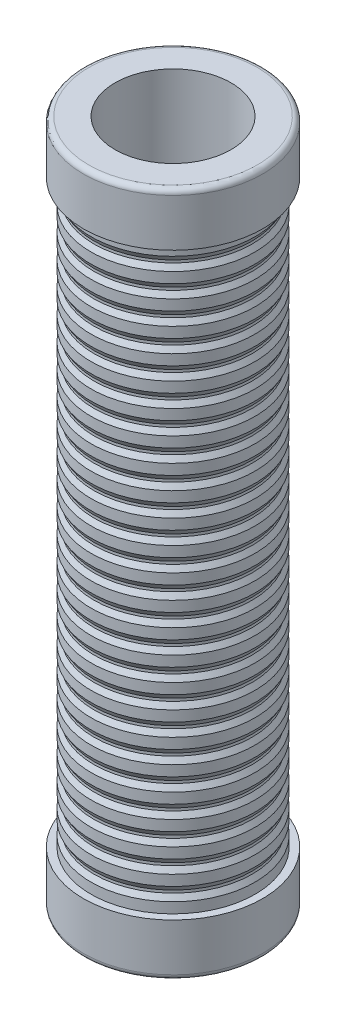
ISO-10303-21;
HEADER;
FILE_DESCRIPTION(('STEP AP214'),'2;1');
FILE_NAME('part.step','',(''),(''),'','','');
FILE_SCHEMA(('AUTOMOTIVE_DESIGN { 1 0 10303 214 1 1 1 1 }'));
ENDSEC;
DATA;
#1=APPLICATION_CONTEXT('core data for automotive mechanical design processes');
#2=APPLICATION_PROTOCOL_DEFINITION('international standard','automotive_design',2000,#1);
#3=PRODUCT_CONTEXT('',#1,'mechanical');
#4=PRODUCT('Part','Part','',(#3));
#5=PRODUCT_RELATED_PRODUCT_CATEGORY('part','',(#4));
#6=PRODUCT_DEFINITION_FORMATION('','',#4);
#7=PRODUCT_DEFINITION_CONTEXT('part definition',#1,'design');
#8=PRODUCT_DEFINITION('design','',#6,#7);
#9=PRODUCT_DEFINITION_SHAPE('','',#8);
#10=(LENGTH_UNIT() NAMED_UNIT(*) SI_UNIT(.MILLI.,.METRE.));
#11=(NAMED_UNIT(*) PLANE_ANGLE_UNIT() SI_UNIT($,.RADIAN.));
#12=(NAMED_UNIT(*) SI_UNIT($,.STERADIAN.) SOLID_ANGLE_UNIT());
#13=UNCERTAINTY_MEASURE_WITH_UNIT(LENGTH_MEASURE(1.E-05),#10,'distance_accuracy_value','');
#14=(GEOMETRIC_REPRESENTATION_CONTEXT(3) GLOBAL_UNCERTAINTY_ASSIGNED_CONTEXT((#13)) GLOBAL_UNIT_ASSIGNED_CONTEXT((#10,
#11,#12)) REPRESENTATION_CONTEXT('',''));
#15=CARTESIAN_POINT('',(0.,0.,0.));
#16=DIRECTION('',(0.,0.,1.));
#17=DIRECTION('',(1.,0.,0.));
#18=AXIS2_PLACEMENT_3D('',#15,#16,#17);
#19=CARTESIAN_POINT('',(0.,130.,0.));
#20=DIRECTION('',(0.,-1.,0.));
#21=DIRECTION('',(0.,0.,-1.));
#22=AXIS2_PLACEMENT_3D('',#19,#20,#21);
#23=CYLINDRICAL_SURFACE('',#22,15.);
#24=CARTESIAN_POINT('',(0.,13.,0.));
#25=DIRECTION('',(0.,-1.,0.));
#26=DIRECTION('',(0.,0.,-1.));
#27=AXIS2_PLACEMENT_3D('',#24,#25,#26);
#28=CIRCLE('',#27,15.0000000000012);
#29=CARTESIAN_POINT('',(0.,13.,-15.0000000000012));
#30=VERTEX_POINT('',#29);
#31=EDGE_CURVE('E338',#30,#30,#28,.T.);
#32=ORIENTED_EDGE('',*,*,#31,.F.);
#33=EDGE_LOOP('',(#32));
#34=FACE_BOUND('',#33,.T.);
#35=CARTESIAN_POINT('',(0.,13.5,0.));
#36=DIRECTION('',(0.,-1.,0.));
#37=DIRECTION('',(0.,0.,-1.));
#38=AXIS2_PLACEMENT_3D('',#35,#36,#37);
#39=CIRCLE('',#38,15.0000000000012);
#40=CARTESIAN_POINT('',(0.,13.5,-15.0000000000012));
#41=VERTEX_POINT('',#40);
#42=EDGE_CURVE('E335',#41,#41,#39,.T.);
#43=ORIENTED_EDGE('',*,*,#42,.T.);
#44=EDGE_LOOP('',(#43));
#45=FACE_BOUND('',#44,.T.);
#46=ADVANCED_FACE('F30',(#34,#45),#23,.T.);
#47=CARTESIAN_POINT('',(0.,17.5,0.));
#48=DIRECTION('',(0.,-1.,0.));
#49=DIRECTION('',(0.,0.,-1.));
#50=AXIS2_PLACEMENT_3D('',#47,#48,#49);
#51=CIRCLE('',#50,15.0000000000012);
#52=CARTESIAN_POINT('',(0.,17.5,-15.0000000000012));
#53=VERTEX_POINT('',#52);
#54=EDGE_CURVE('E326',#53,#53,#51,.T.);
#55=ORIENTED_EDGE('',*,*,#54,.F.);
#56=EDGE_LOOP('',(#55));
#57=FACE_BOUND('',#56,.T.);
#58=CARTESIAN_POINT('',(0.,18.,0.));
#59=DIRECTION('',(0.,-1.,0.));
#60=DIRECTION('',(0.,0.,-1.));
#61=AXIS2_PLACEMENT_3D('',#58,#59,#60);
#62=CIRCLE('',#61,15.0000000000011);
#63=CARTESIAN_POINT('',(0.,18.,-15.0000000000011));
#64=VERTEX_POINT('',#63);
#65=EDGE_CURVE('E323',#64,#64,#62,.T.);
#66=ORIENTED_EDGE('',*,*,#65,.T.);
#67=EDGE_LOOP('',(#66));
#68=FACE_BOUND('',#67,.T.);
#69=ADVANCED_FACE('F373',(#57,#68),#23,.T.);
#70=CARTESIAN_POINT('',(0.,22.,0.));
#71=DIRECTION('',(0.,-1.,0.));
#72=DIRECTION('',(0.,0.,-1.));
#73=AXIS2_PLACEMENT_3D('',#70,#71,#72);
#74=CIRCLE('',#73,15.0000000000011);
#75=CARTESIAN_POINT('',(0.,22.,-15.0000000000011));
#76=VERTEX_POINT('',#75);
#77=EDGE_CURVE('E314',#76,#76,#74,.T.);
#78=ORIENTED_EDGE('',*,*,#77,.F.);
#79=EDGE_LOOP('',(#78));
#80=FACE_BOUND('',#79,.T.);
#81=CARTESIAN_POINT('',(0.,22.5,0.));
#82=DIRECTION('',(0.,-1.,0.));
#83=DIRECTION('',(0.,0.,-1.));
#84=AXIS2_PLACEMENT_3D('',#81,#82,#83);
#85=CIRCLE('',#84,15.0000000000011);
#86=CARTESIAN_POINT('',(0.,22.5,-15.0000000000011));
#87=VERTEX_POINT('',#86);
#88=EDGE_CURVE('E311',#87,#87,#85,.T.);
#89=ORIENTED_EDGE('',*,*,#88,.T.);
#90=EDGE_LOOP('',(#89));
#91=FACE_BOUND('',#90,.T.);
#92=ADVANCED_FACE('F380',(#80,#91),#23,.T.);
#93=CARTESIAN_POINT('',(0.,26.5,0.));
#94=DIRECTION('',(0.,-1.,0.));
#95=DIRECTION('',(0.,0.,-1.));
#96=AXIS2_PLACEMENT_3D('',#93,#94,#95);
#97=CIRCLE('',#96,15.0000000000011);
#98=CARTESIAN_POINT('',(0.,26.5,-15.0000000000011));
#99=VERTEX_POINT('',#98);
#100=EDGE_CURVE('E302',#99,#99,#97,.T.);
#101=ORIENTED_EDGE('',*,*,#100,.F.);
#102=EDGE_LOOP('',(#101));
#103=FACE_BOUND('',#102,.T.);
#104=CARTESIAN_POINT('',(0.,27.,0.));
#105=DIRECTION('',(0.,-1.,0.));
#106=DIRECTION('',(0.,0.,-1.));
#107=AXIS2_PLACEMENT_3D('',#104,#105,#106);
#108=CIRCLE('',#107,15.000000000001);
#109=CARTESIAN_POINT('',(0.,27.,-15.000000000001));
#110=VERTEX_POINT('',#109);
#111=EDGE_CURVE('E299',#110,#110,#108,.T.);
#112=ORIENTED_EDGE('',*,*,#111,.T.);
#113=EDGE_LOOP('',(#112));
#114=FACE_BOUND('',#113,.T.);
#115=ADVANCED_FACE('F1390',(#103,#114),#23,.T.);
#116=CARTESIAN_POINT('',(0.,31.,0.));
#117=DIRECTION('',(0.,-1.,0.));
#118=DIRECTION('',(0.,0.,-1.));
#119=AXIS2_PLACEMENT_3D('',#116,#117,#118);
#120=CIRCLE('',#119,15.000000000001);
#121=CARTESIAN_POINT('',(0.,31.,-15.000000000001));
#122=VERTEX_POINT('',#121);
#123=EDGE_CURVE('E290',#122,#122,#120,.T.);
#124=ORIENTED_EDGE('',*,*,#123,.F.);
#125=EDGE_LOOP('',(#124));
#126=FACE_BOUND('',#125,.T.);
#127=CARTESIAN_POINT('',(0.,31.5,0.));
#128=DIRECTION('',(0.,-1.,0.));
#129=DIRECTION('',(0.,0.,-1.));
#130=AXIS2_PLACEMENT_3D('',#127,#128,#129);
#131=CIRCLE('',#130,15.000000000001);
#132=CARTESIAN_POINT('',(0.,31.5,-15.000000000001));
#133=VERTEX_POINT('',#132);
#134=EDGE_CURVE('E287',#133,#133,#131,.T.);
#135=ORIENTED_EDGE('',*,*,#134,.T.);
#136=EDGE_LOOP('',(#135));
#137=FACE_BOUND('',#136,.T.);
#138=ADVANCED_FACE('F1381',(#126,#137),#23,.T.);
#139=CARTESIAN_POINT('',(0.,35.5,0.));
#140=DIRECTION('',(0.,-1.,0.));
#141=DIRECTION('',(0.,0.,-1.));
#142=AXIS2_PLACEMENT_3D('',#139,#140,#141);
#143=CIRCLE('',#142,15.000000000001);
#144=CARTESIAN_POINT('',(0.,35.5,-15.000000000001));
#145=VERTEX_POINT('',#144);
#146=EDGE_CURVE('E278',#145,#145,#143,.T.);
#147=ORIENTED_EDGE('',*,*,#146,.F.);
#148=EDGE_LOOP('',(#147));
#149=FACE_BOUND('',#148,.T.);
#150=CARTESIAN_POINT('',(0.,36.,0.));
#151=DIRECTION('',(0.,-1.,0.));
#152=DIRECTION('',(0.,0.,-1.));
#153=AXIS2_PLACEMENT_3D('',#150,#151,#152);
#154=CIRCLE('',#153,15.0000000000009);
#155=CARTESIAN_POINT('',(0.,36.,-15.0000000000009));
#156=VERTEX_POINT('',#155);
#157=EDGE_CURVE('E275',#156,#156,#154,.T.);
#158=ORIENTED_EDGE('',*,*,#157,.T.);
#159=EDGE_LOOP('',(#158));
#160=FACE_BOUND('',#159,.T.);
#161=ADVANCED_FACE('F1372',(#149,#160),#23,.T.);
#162=CARTESIAN_POINT('',(0.,40.,0.));
#163=DIRECTION('',(0.,-1.,0.));
#164=DIRECTION('',(0.,0.,-1.));
#165=AXIS2_PLACEMENT_3D('',#162,#163,#164);
#166=CIRCLE('',#165,15.0000000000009);
#167=CARTESIAN_POINT('',(0.,40.,-15.0000000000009));
#168=VERTEX_POINT('',#167);
#169=EDGE_CURVE('E266',#168,#168,#166,.T.);
#170=ORIENTED_EDGE('',*,*,#169,.F.);
#171=EDGE_LOOP('',(#170));
#172=FACE_BOUND('',#171,.T.);
#173=CARTESIAN_POINT('',(0.,40.5,0.));
#174=DIRECTION('',(0.,-1.,0.));
#175=DIRECTION('',(0.,0.,-1.));
#176=AXIS2_PLACEMENT_3D('',#173,#174,#175);
#177=CIRCLE('',#176,15.0000000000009);
#178=CARTESIAN_POINT('',(0.,40.5,-15.0000000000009));
#179=VERTEX_POINT('',#178);
#180=EDGE_CURVE('E263',#179,#179,#177,.T.);
#181=ORIENTED_EDGE('',*,*,#180,.T.);
#182=EDGE_LOOP('',(#181));
#183=FACE_BOUND('',#182,.T.);
#184=ADVANCED_FACE('F1363',(#172,#183),#23,.T.);
#185=CARTESIAN_POINT('',(0.,44.5,0.));
#186=DIRECTION('',(0.,-1.,0.));
#187=DIRECTION('',(0.,0.,-1.));
#188=AXIS2_PLACEMENT_3D('',#185,#186,#187);
#189=CIRCLE('',#188,15.0000000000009);
#190=CARTESIAN_POINT('',(0.,44.5,-15.0000000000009));
#191=VERTEX_POINT('',#190);
#192=EDGE_CURVE('E254',#191,#191,#189,.T.);
#193=ORIENTED_EDGE('',*,*,#192,.F.);
#194=EDGE_LOOP('',(#193));
#195=FACE_BOUND('',#194,.T.);
#196=CARTESIAN_POINT('',(0.,45.,0.));
#197=DIRECTION('',(0.,-1.,0.));
#198=DIRECTION('',(0.,0.,-1.));
#199=AXIS2_PLACEMENT_3D('',#196,#197,#198);
#200=CIRCLE('',#199,15.0000000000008);
#201=CARTESIAN_POINT('',(0.,45.,-15.0000000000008));
#202=VERTEX_POINT('',#201);
#203=EDGE_CURVE('E251',#202,#202,#200,.T.);
#204=ORIENTED_EDGE('',*,*,#203,.T.);
#205=EDGE_LOOP('',(#204));
#206=FACE_BOUND('',#205,.T.);
#207=ADVANCED_FACE('F1354',(#195,#206),#23,.T.);
#208=CARTESIAN_POINT('',(0.,49.,0.));
#209=DIRECTION('',(0.,-1.,0.));
#210=DIRECTION('',(0.,0.,-1.));
#211=AXIS2_PLACEMENT_3D('',#208,#209,#210);
#212=CIRCLE('',#211,15.0000000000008);
#213=CARTESIAN_POINT('',(0.,49.,-15.0000000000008));
#214=VERTEX_POINT('',#213);
#215=EDGE_CURVE('E242',#214,#214,#212,.T.);
#216=ORIENTED_EDGE('',*,*,#215,.F.);
#217=EDGE_LOOP('',(#216));
#218=FACE_BOUND('',#217,.T.);
#219=CARTESIAN_POINT('',(0.,49.5,0.));
#220=DIRECTION('',(0.,-1.,0.));
#221=DIRECTION('',(0.,0.,-1.));
#222=AXIS2_PLACEMENT_3D('',#219,#220,#221);
#223=CIRCLE('',#222,15.0000000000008);
#224=CARTESIAN_POINT('',(0.,49.5,-15.0000000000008));
#225=VERTEX_POINT('',#224);
#226=EDGE_CURVE('E239',#225,#225,#223,.T.);
#227=ORIENTED_EDGE('',*,*,#226,.T.);
#228=EDGE_LOOP('',(#227));
#229=FACE_BOUND('',#228,.T.);
#230=ADVANCED_FACE('F1345',(#218,#229),#23,.T.);
#231=CARTESIAN_POINT('',(0.,53.5,0.));
#232=DIRECTION('',(0.,-1.,0.));
#233=DIRECTION('',(0.,0.,-1.));
#234=AXIS2_PLACEMENT_3D('',#231,#232,#233);
#235=CIRCLE('',#234,15.0000000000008);
#236=CARTESIAN_POINT('',(0.,53.5,-15.0000000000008));
#237=VERTEX_POINT('',#236);
#238=EDGE_CURVE('E230',#237,#237,#235,.T.);
#239=ORIENTED_EDGE('',*,*,#238,.F.);
#240=EDGE_LOOP('',(#239));
#241=FACE_BOUND('',#240,.T.);
#242=CARTESIAN_POINT('',(0.,54.,0.));
#243=DIRECTION('',(0.,-1.,0.));
#244=DIRECTION('',(0.,0.,-1.));
#245=AXIS2_PLACEMENT_3D('',#242,#243,#244);
#246=CIRCLE('',#245,15.0000000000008);
#247=CARTESIAN_POINT('',(0.,54.,-15.0000000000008));
#248=VERTEX_POINT('',#247);
#249=EDGE_CURVE('E227',#248,#248,#246,.T.);
#250=ORIENTED_EDGE('',*,*,#249,.T.);
#251=EDGE_LOOP('',(#250));
#252=FACE_BOUND('',#251,.T.);
#253=ADVANCED_FACE('F1336',(#241,#252),#23,.T.);
#254=CARTESIAN_POINT('',(0.,58.,0.));
#255=DIRECTION('',(0.,-1.,0.));
#256=DIRECTION('',(0.,0.,-1.));
#257=AXIS2_PLACEMENT_3D('',#254,#255,#256);
#258=CIRCLE('',#257,15.0000000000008);
#259=CARTESIAN_POINT('',(0.,58.,-15.0000000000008));
#260=VERTEX_POINT('',#259);
#261=EDGE_CURVE('E218',#260,#260,#258,.T.);
#262=ORIENTED_EDGE('',*,*,#261,.F.);
#263=EDGE_LOOP('',(#262));
#264=FACE_BOUND('',#263,.T.);
#265=CARTESIAN_POINT('',(0.,58.5,0.));
#266=DIRECTION('',(0.,-1.,0.));
#267=DIRECTION('',(0.,0.,-1.));
#268=AXIS2_PLACEMENT_3D('',#265,#266,#267);
#269=CIRCLE('',#268,15.0000000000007);
#270=CARTESIAN_POINT('',(0.,58.5,-15.0000000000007));
#271=VERTEX_POINT('',#270);
#272=EDGE_CURVE('E215',#271,#271,#269,.T.);
#273=ORIENTED_EDGE('',*,*,#272,.T.);
#274=EDGE_LOOP('',(#273));
#275=FACE_BOUND('',#274,.T.);
#276=ADVANCED_FACE('F1327',(#264,#275),#23,.T.);
#277=CARTESIAN_POINT('',(0.,62.5,0.));
#278=DIRECTION('',(0.,-1.,0.));
#279=DIRECTION('',(0.,0.,-1.));
#280=AXIS2_PLACEMENT_3D('',#277,#278,#279);
#281=CIRCLE('',#280,15.0000000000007);
#282=CARTESIAN_POINT('',(0.,62.5,-15.0000000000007));
#283=VERTEX_POINT('',#282);
#284=EDGE_CURVE('E206',#283,#283,#281,.T.);
#285=ORIENTED_EDGE('',*,*,#284,.F.);
#286=EDGE_LOOP('',(#285));
#287=FACE_BOUND('',#286,.T.);
#288=CARTESIAN_POINT('',(0.,63.,0.));
#289=DIRECTION('',(0.,-1.,0.));
#290=DIRECTION('',(0.,0.,-1.));
#291=AXIS2_PLACEMENT_3D('',#288,#289,#290);
#292=CIRCLE('',#291,15.0000000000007);
#293=CARTESIAN_POINT('',(0.,63.,-15.0000000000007));
#294=VERTEX_POINT('',#293);
#295=EDGE_CURVE('E203',#294,#294,#292,.T.);
#296=ORIENTED_EDGE('',*,*,#295,.T.);
#297=EDGE_LOOP('',(#296));
#298=FACE_BOUND('',#297,.T.);
#299=ADVANCED_FACE('F1318',(#287,#298),#23,.T.);
#300=CARTESIAN_POINT('',(0.,67.,0.));
#301=DIRECTION('',(0.,-1.,0.));
#302=DIRECTION('',(0.,0.,-1.));
#303=AXIS2_PLACEMENT_3D('',#300,#301,#302);
#304=CIRCLE('',#303,15.0000000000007);
#305=CARTESIAN_POINT('',(0.,67.,-15.0000000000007));
#306=VERTEX_POINT('',#305);
#307=EDGE_CURVE('E194',#306,#306,#304,.T.);
#308=ORIENTED_EDGE('',*,*,#307,.F.);
#309=EDGE_LOOP('',(#308));
#310=FACE_BOUND('',#309,.T.);
#311=CARTESIAN_POINT('',(0.,67.5,0.));
#312=DIRECTION('',(0.,-1.,0.));
#313=DIRECTION('',(0.,0.,-1.));
#314=AXIS2_PLACEMENT_3D('',#311,#312,#313);
#315=CIRCLE('',#314,15.0000000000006);
#316=CARTESIAN_POINT('',(0.,67.5,-15.0000000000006));
#317=VERTEX_POINT('',#316);
#318=EDGE_CURVE('E191',#317,#317,#315,.T.);
#319=ORIENTED_EDGE('',*,*,#318,.T.);
#320=EDGE_LOOP('',(#319));
#321=FACE_BOUND('',#320,.T.);
#322=ADVANCED_FACE('F1309',(#310,#321),#23,.T.);
#323=CARTESIAN_POINT('',(0.,71.5,0.));
#324=DIRECTION('',(0.,-1.,0.));
#325=DIRECTION('',(0.,0.,-1.));
#326=AXIS2_PLACEMENT_3D('',#323,#324,#325);
#327=CIRCLE('',#326,15.0000000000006);
#328=CARTESIAN_POINT('',(0.,71.5,-15.0000000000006));
#329=VERTEX_POINT('',#328);
#330=EDGE_CURVE('E182',#329,#329,#327,.T.);
#331=ORIENTED_EDGE('',*,*,#330,.F.);
#332=EDGE_LOOP('',(#331));
#333=FACE_BOUND('',#332,.T.);
#334=CARTESIAN_POINT('',(0.,72.,0.));
#335=DIRECTION('',(0.,-1.,0.));
#336=DIRECTION('',(0.,0.,-1.));
#337=AXIS2_PLACEMENT_3D('',#334,#335,#336);
#338=CIRCLE('',#337,15.0000000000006);
#339=CARTESIAN_POINT('',(0.,72.,-15.0000000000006));
#340=VERTEX_POINT('',#339);
#341=EDGE_CURVE('E179',#340,#340,#338,.T.);
#342=ORIENTED_EDGE('',*,*,#341,.T.);
#343=EDGE_LOOP('',(#342));
#344=FACE_BOUND('',#343,.T.);
#345=ADVANCED_FACE('F1300',(#333,#344),#23,.T.);
#346=CARTESIAN_POINT('',(0.,76.,0.));
#347=DIRECTION('',(0.,-1.,0.));
#348=DIRECTION('',(0.,0.,-1.));
#349=AXIS2_PLACEMENT_3D('',#346,#347,#348);
#350=CIRCLE('',#349,15.0000000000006);
#351=CARTESIAN_POINT('',(0.,76.,-15.0000000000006));
#352=VERTEX_POINT('',#351);
#353=EDGE_CURVE('E170',#352,#352,#350,.T.);
#354=ORIENTED_EDGE('',*,*,#353,.F.);
#355=EDGE_LOOP('',(#354));
#356=FACE_BOUND('',#355,.T.);
#357=CARTESIAN_POINT('',(0.,76.5,0.));
#358=DIRECTION('',(0.,-1.,0.));
#359=DIRECTION('',(0.,0.,-1.));
#360=AXIS2_PLACEMENT_3D('',#357,#358,#359);
#361=CIRCLE('',#360,15.0000000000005);
#362=CARTESIAN_POINT('',(0.,76.5,-15.0000000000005));
#363=VERTEX_POINT('',#362);
#364=EDGE_CURVE('E167',#363,#363,#361,.T.);
#365=ORIENTED_EDGE('',*,*,#364,.T.);
#366=EDGE_LOOP('',(#365));
#367=FACE_BOUND('',#366,.T.);
#368=ADVANCED_FACE('F1291',(#356,#367),#23,.T.);
#369=CARTESIAN_POINT('',(0.,80.5,0.));
#370=DIRECTION('',(0.,-1.,0.));
#371=DIRECTION('',(0.,0.,-1.));
#372=AXIS2_PLACEMENT_3D('',#369,#370,#371);
#373=CIRCLE('',#372,15.0000000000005);
#374=CARTESIAN_POINT('',(0.,80.5,-15.0000000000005));
#375=VERTEX_POINT('',#374);
#376=EDGE_CURVE('E158',#375,#375,#373,.T.);
#377=ORIENTED_EDGE('',*,*,#376,.F.);
#378=EDGE_LOOP('',(#377));
#379=FACE_BOUND('',#378,.T.);
#380=CARTESIAN_POINT('',(0.,81.,0.));
#381=DIRECTION('',(0.,-1.,0.));
#382=DIRECTION('',(0.,0.,-1.));
#383=AXIS2_PLACEMENT_3D('',#380,#381,#382);
#384=CIRCLE('',#383,15.0000000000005);
#385=CARTESIAN_POINT('',(0.,81.,-15.0000000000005));
#386=VERTEX_POINT('',#385);
#387=EDGE_CURVE('E155',#386,#386,#384,.T.);
#388=ORIENTED_EDGE('',*,*,#387,.T.);
#389=EDGE_LOOP('',(#388));
#390=FACE_BOUND('',#389,.T.);
#391=ADVANCED_FACE('F1282',(#379,#390),#23,.T.);
#392=CARTESIAN_POINT('',(0.,85.,0.));
#393=DIRECTION('',(0.,-1.,0.));
#394=DIRECTION('',(0.,0.,-1.));
#395=AXIS2_PLACEMENT_3D('',#392,#393,#394);
#396=CIRCLE('',#395,15.0000000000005);
#397=CARTESIAN_POINT('',(0.,85.,-15.0000000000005));
#398=VERTEX_POINT('',#397);
#399=EDGE_CURVE('E146',#398,#398,#396,.T.);
#400=ORIENTED_EDGE('',*,*,#399,.F.);
#401=EDGE_LOOP('',(#400));
#402=FACE_BOUND('',#401,.T.);
#403=CARTESIAN_POINT('',(0.,85.5,0.));
#404=DIRECTION('',(0.,-1.,0.));
#405=DIRECTION('',(0.,0.,-1.));
#406=AXIS2_PLACEMENT_3D('',#403,#404,#405);
#407=CIRCLE('',#406,15.0000000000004);
#408=CARTESIAN_POINT('',(0.,85.5,-15.0000000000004));
#409=VERTEX_POINT('',#408);
#410=EDGE_CURVE('E143',#409,#409,#407,.T.);
#411=ORIENTED_EDGE('',*,*,#410,.T.);
#412=EDGE_LOOP('',(#411));
#413=FACE_BOUND('',#412,.T.);
#414=ADVANCED_FACE('F1273',(#402,#413),#23,.T.);
#415=CARTESIAN_POINT('',(0.,89.5,0.));
#416=DIRECTION('',(0.,-1.,0.));
#417=DIRECTION('',(0.,0.,-1.));
#418=AXIS2_PLACEMENT_3D('',#415,#416,#417);
#419=CIRCLE('',#418,15.0000000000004);
#420=CARTESIAN_POINT('',(0.,89.5,-15.0000000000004));
#421=VERTEX_POINT('',#420);
#422=EDGE_CURVE('E134',#421,#421,#419,.T.);
#423=ORIENTED_EDGE('',*,*,#422,.F.);
#424=EDGE_LOOP('',(#423));
#425=FACE_BOUND('',#424,.T.);
#426=CARTESIAN_POINT('',(0.,90.,0.));
#427=DIRECTION('',(0.,-1.,0.));
#428=DIRECTION('',(0.,0.,-1.));
#429=AXIS2_PLACEMENT_3D('',#426,#427,#428);
#430=CIRCLE('',#429,15.0000000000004);
#431=CARTESIAN_POINT('',(0.,90.,-15.0000000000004));
#432=VERTEX_POINT('',#431);
#433=EDGE_CURVE('E131',#432,#432,#430,.T.);
#434=ORIENTED_EDGE('',*,*,#433,.T.);
#435=EDGE_LOOP('',(#434));
#436=FACE_BOUND('',#435,.T.);
#437=ADVANCED_FACE('F1264',(#425,#436),#23,.T.);
#438=CARTESIAN_POINT('',(0.,94.,0.));
#439=DIRECTION('',(0.,-1.,0.));
#440=DIRECTION('',(0.,0.,-1.));
#441=AXIS2_PLACEMENT_3D('',#438,#439,#440);
#442=CIRCLE('',#441,15.0000000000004);
#443=CARTESIAN_POINT('',(0.,94.,-15.0000000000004));
#444=VERTEX_POINT('',#443);
#445=EDGE_CURVE('E122',#444,#444,#442,.T.);
#446=ORIENTED_EDGE('',*,*,#445,.F.);
#447=EDGE_LOOP('',(#446));
#448=FACE_BOUND('',#447,.T.);
#449=CARTESIAN_POINT('',(0.,94.5,0.));
#450=DIRECTION('',(0.,-1.,0.));
#451=DIRECTION('',(0.,0.,-1.));
#452=AXIS2_PLACEMENT_3D('',#449,#450,#451);
#453=CIRCLE('',#452,15.0000000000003);
#454=CARTESIAN_POINT('',(0.,94.5,-15.0000000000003));
#455=VERTEX_POINT('',#454);
#456=EDGE_CURVE('E119',#455,#455,#453,.T.);
#457=ORIENTED_EDGE('',*,*,#456,.T.);
#458=EDGE_LOOP('',(#457));
#459=FACE_BOUND('',#458,.T.);
#460=ADVANCED_FACE('F1255',(#448,#459),#23,.T.);
#461=CARTESIAN_POINT('',(0.,98.5,0.));
#462=DIRECTION('',(0.,-1.,0.));
#463=DIRECTION('',(0.,0.,-1.));
#464=AXIS2_PLACEMENT_3D('',#461,#462,#463);
#465=CIRCLE('',#464,15.0000000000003);
#466=CARTESIAN_POINT('',(0.,98.5,-15.0000000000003));
#467=VERTEX_POINT('',#466);
#468=EDGE_CURVE('E110',#467,#467,#465,.T.);
#469=ORIENTED_EDGE('',*,*,#468,.F.);
#470=EDGE_LOOP('',(#469));
#471=FACE_BOUND('',#470,.T.);
#472=CARTESIAN_POINT('',(0.,99.,0.));
#473=DIRECTION('',(0.,-1.,0.));
#474=DIRECTION('',(0.,0.,-1.));
#475=AXIS2_PLACEMENT_3D('',#472,#473,#474);
#476=CIRCLE('',#475,15.0000000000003);
#477=CARTESIAN_POINT('',(0.,99.,-15.0000000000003));
#478=VERTEX_POINT('',#477);
#479=EDGE_CURVE('E107',#478,#478,#476,.T.);
#480=ORIENTED_EDGE('',*,*,#479,.T.);
#481=EDGE_LOOP('',(#480));
#482=FACE_BOUND('',#481,.T.);
#483=ADVANCED_FACE('F1246',(#471,#482),#23,.T.);
#484=CARTESIAN_POINT('',(0.,103.,0.));
#485=DIRECTION('',(0.,-1.,0.));
#486=DIRECTION('',(0.,0.,-1.));
#487=AXIS2_PLACEMENT_3D('',#484,#485,#486);
#488=CIRCLE('',#487,15.0000000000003);
#489=CARTESIAN_POINT('',(0.,103.,-15.0000000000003));
#490=VERTEX_POINT('',#489);
#491=EDGE_CURVE('E98',#490,#490,#488,.T.);
#492=ORIENTED_EDGE('',*,*,#491,.F.);
#493=EDGE_LOOP('',(#492));
#494=FACE_BOUND('',#493,.T.);
#495=CARTESIAN_POINT('',(0.,103.5,0.));
#496=DIRECTION('',(0.,-1.,0.));
#497=DIRECTION('',(0.,0.,-1.));
#498=AXIS2_PLACEMENT_3D('',#495,#496,#497);
#499=CIRCLE('',#498,15.0000000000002);
#500=CARTESIAN_POINT('',(0.,103.5,-15.0000000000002));
#501=VERTEX_POINT('',#500);
#502=EDGE_CURVE('E95',#501,#501,#499,.T.);
#503=ORIENTED_EDGE('',*,*,#502,.T.);
#504=EDGE_LOOP('',(#503));
#505=FACE_BOUND('',#504,.T.);
#506=ADVANCED_FACE('F1237',(#494,#505),#23,.T.);
#507=CARTESIAN_POINT('',(0.,107.5,0.));
#508=DIRECTION('',(0.,-1.,0.));
#509=DIRECTION('',(0.,0.,-1.));
#510=AXIS2_PLACEMENT_3D('',#507,#508,#509);
#511=CIRCLE('',#510,15.0000000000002);
#512=CARTESIAN_POINT('',(0.,107.5,-15.0000000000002));
#513=VERTEX_POINT('',#512);
#514=EDGE_CURVE('E86',#513,#513,#511,.T.);
#515=ORIENTED_EDGE('',*,*,#514,.F.);
#516=EDGE_LOOP('',(#515));
#517=FACE_BOUND('',#516,.T.);
#518=CARTESIAN_POINT('',(0.,108.,0.));
#519=DIRECTION('',(0.,-1.,0.));
#520=DIRECTION('',(0.,0.,-1.));
#521=AXIS2_PLACEMENT_3D('',#518,#519,#520);
#522=CIRCLE('',#521,15.0000000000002);
#523=CARTESIAN_POINT('',(0.,108.,-15.0000000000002));
#524=VERTEX_POINT('',#523);
#525=EDGE_CURVE('E83',#524,#524,#522,.T.);
#526=ORIENTED_EDGE('',*,*,#525,.T.);
#527=EDGE_LOOP('',(#526));
#528=FACE_BOUND('',#527,.T.);
#529=ADVANCED_FACE('F395',(#517,#528),#23,.T.);
#530=CARTESIAN_POINT('',(0.,112.,0.));
#531=DIRECTION('',(0.,-1.,0.));
#532=DIRECTION('',(0.,0.,-1.));
#533=AXIS2_PLACEMENT_3D('',#530,#531,#532);
#534=CIRCLE('',#533,15.0000000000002);
#535=CARTESIAN_POINT('',(0.,112.,-15.0000000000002));
#536=VERTEX_POINT('',#535);
#537=EDGE_CURVE('E74',#536,#536,#534,.T.);
#538=ORIENTED_EDGE('',*,*,#537,.F.);
#539=EDGE_LOOP('',(#538));
#540=FACE_BOUND('',#539,.T.);
#541=CARTESIAN_POINT('',(0.,112.5,0.));
#542=DIRECTION('',(0.,-1.,0.));
#543=DIRECTION('',(0.,0.,-1.));
#544=AXIS2_PLACEMENT_3D('',#541,#542,#543);
#545=CIRCLE('',#544,15.0000000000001);
#546=CARTESIAN_POINT('',(0.,112.5,-15.0000000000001));
#547=VERTEX_POINT('',#546);
#548=EDGE_CURVE('E71',#547,#547,#545,.T.);
#549=ORIENTED_EDGE('',*,*,#548,.T.);
#550=EDGE_LOOP('',(#549));
#551=FACE_BOUND('',#550,.T.);
#552=ADVANCED_FACE('F387',(#540,#551),#23,.T.);
#553=CARTESIAN_POINT('',(0.,116.5,0.));
#554=DIRECTION('',(0.,-1.,0.));
#555=DIRECTION('',(0.,0.,-1.));
#556=AXIS2_PLACEMENT_3D('',#553,#554,#555);
#557=CIRCLE('',#556,15.0000000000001);
#558=CARTESIAN_POINT('',(0.,116.5,-15.0000000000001));
#559=VERTEX_POINT('',#558);
#560=EDGE_CURVE('E62',#559,#559,#557,.T.);
#561=ORIENTED_EDGE('',*,*,#560,.F.);
#562=EDGE_LOOP('',(#561));
#563=FACE_BOUND('',#562,.T.);
#564=CARTESIAN_POINT('',(0.,117.,0.));
#565=DIRECTION('',(0.,-1.,0.));
#566=DIRECTION('',(0.,0.,-1.));
#567=AXIS2_PLACEMENT_3D('',#564,#565,#566);
#568=CIRCLE('',#567,15.0000000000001);
#569=CARTESIAN_POINT('',(0.,117.,-15.0000000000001));
#570=VERTEX_POINT('',#569);
#571=EDGE_CURVE('E59',#570,#570,#568,.T.);
#572=ORIENTED_EDGE('',*,*,#571,.T.);
#573=EDGE_LOOP('',(#572));
#574=FACE_BOUND('',#573,.T.);
#575=ADVANCED_FACE('F376',(#563,#574),#23,.T.);
#576=CARTESIAN_POINT('',(0.,130.,0.));
#577=DIRECTION('',(0.,1.,0.));
#578=DIRECTION('',(0.,0.,1.));
#579=AXIS2_PLACEMENT_3D('',#576,#577,#578);
#580=PLANE('',#579);
#581=CARTESIAN_POINT('',(0.,130.,0.));
#582=DIRECTION('',(0.,1.,0.));
#583=DIRECTION('',(0.,0.,1.));
#584=AXIS2_PLACEMENT_3D('',#581,#582,#583);
#585=CIRCLE('',#584,16.);
#586=CARTESIAN_POINT('',(0.,130.,16.));
#587=VERTEX_POINT('',#586);
#588=EDGE_CURVE('E37',#587,#587,#585,.T.);
#589=ORIENTED_EDGE('',*,*,#588,.T.);
#590=EDGE_LOOP('',(#589));
#591=FACE_BOUND('',#590,.T.);
#592=CARTESIAN_POINT('',(0.,130.,0.));
#593=DIRECTION('',(0.,1.,0.));
#594=DIRECTION('',(0.,0.,1.));
#595=AXIS2_PLACEMENT_3D('',#592,#593,#594);
#596=CIRCLE('',#595,11.);
#597=CARTESIAN_POINT('',(0.,130.,11.));
#598=VERTEX_POINT('',#597);
#599=EDGE_CURVE('E50',#598,#598,#596,.T.);
#600=ORIENTED_EDGE('',*,*,#599,.F.);
#601=EDGE_LOOP('',(#600));
#602=FACE_BOUND('',#601,.T.);
#603=ADVANCED_FACE('F386',(#591,#602),#580,.T.);
#604=CARTESIAN_POINT('',(0.,0.,0.));
#605=DIRECTION('',(0.,1.,0.));
#606=DIRECTION('',(0.,0.,1.));
#607=AXIS2_PLACEMENT_3D('',#604,#605,#606);
#608=PLANE('',#607);
#609=CARTESIAN_POINT('',(0.,0.,0.));
#610=DIRECTION('',(0.,1.,0.));
#611=DIRECTION('',(0.,0.,1.));
#612=AXIS2_PLACEMENT_3D('',#609,#610,#611);
#613=CIRCLE('',#612,16.);
#614=CARTESIAN_POINT('',(0.,0.,16.));
#615=VERTEX_POINT('',#614);
#616=EDGE_CURVE('E41',#615,#615,#613,.F.);
#617=ORIENTED_EDGE('',*,*,#616,.T.);
#618=EDGE_LOOP('',(#617));
#619=FACE_BOUND('',#618,.T.);
#620=CARTESIAN_POINT('',(0.,0.,0.));
#621=DIRECTION('',(0.,1.,0.));
#622=DIRECTION('',(0.,0.,1.));
#623=AXIS2_PLACEMENT_3D('',#620,#621,#622);
#624=CIRCLE('',#623,11.);
#625=CARTESIAN_POINT('',(0.,0.,11.));
#626=VERTEX_POINT('',#625);
#627=EDGE_CURVE('E51',#626,#626,#624,.T.);
#628=ORIENTED_EDGE('',*,*,#627,.T.);
#629=EDGE_LOOP('',(#628));
#630=FACE_BOUND('',#629,.T.);
#631=ADVANCED_FACE('F393',(#619,#630),#608,.F.);
#632=CARTESIAN_POINT('',(0.,130.,0.));
#633=DIRECTION('',(0.,-1.,0.));
#634=DIRECTION('',(0.,0.,-1.));
#635=AXIS2_PLACEMENT_3D('',#632,#633,#634);
#636=CYLINDRICAL_SURFACE('',#635,11.);
#637=ORIENTED_EDGE('',*,*,#599,.T.);
#638=EDGE_LOOP('',(#637));
#639=FACE_BOUND('',#638,.T.);
#640=ORIENTED_EDGE('',*,*,#627,.F.);
#641=EDGE_LOOP('',(#640));
#642=FACE_BOUND('',#641,.T.);
#643=ADVANCED_FACE('F414',(#639,#642),#636,.F.);
#644=CARTESIAN_POINT('',(0.,0.,0.));
#645=DIRECTION('',(0.,-1.,0.));
#646=DIRECTION('',(0.,0.,-1.));
#647=AXIS2_PLACEMENT_3D('',#644,#645,#646);
#648=CYLINDRICAL_SURFACE('',#647,15.5773502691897);
#649=CARTESIAN_POINT('',(0.,120.,0.));
#650=DIRECTION('',(0.,1.,0.));
#651=DIRECTION('',(0.,0.,1.));
#652=AXIS2_PLACEMENT_3D('',#649,#650,#651);
#653=CIRCLE('',#652,15.5773502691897);
#654=CARTESIAN_POINT('',(0.,120.,15.5773502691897));
#655=VERTEX_POINT('',#654);
#656=EDGE_CURVE('E350',#655,#655,#653,.F.);
#657=ORIENTED_EDGE('',*,*,#656,.T.);
#658=EDGE_LOOP('',(#657));
#659=FACE_BOUND('',#658,.T.);
#660=CARTESIAN_POINT('',(0.,118.,0.));
#661=DIRECTION('',(0.,-1.,0.));
#662=DIRECTION('',(0.,0.,-1.));
#663=AXIS2_PLACEMENT_3D('',#660,#661,#662);
#664=CIRCLE('',#663,15.5773502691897);
#665=CARTESIAN_POINT('',(0.,118.,-15.5773502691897));
#666=VERTEX_POINT('',#665);
#667=EDGE_CURVE('E54',#666,#666,#664,.T.);
#668=ORIENTED_EDGE('',*,*,#667,.F.);
#669=EDGE_LOOP('',(#668));
#670=FACE_BOUND('',#669,.T.);
#671=ADVANCED_FACE('F404',(#659,#670),#648,.T.);
#672=CARTESIAN_POINT('',(0.,117.,0.));
#673=DIRECTION('',(0.,1.,0.));
#674=DIRECTION('',(0.,0.,1.));
#675=AXIS2_PLACEMENT_3D('',#672,#673,#674);
#676=CONICAL_SURFACE('',#675,15.0000000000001,0.523598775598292);
#677=ORIENTED_EDGE('',*,*,#667,.T.);
#678=EDGE_LOOP('',(#677));
#679=FACE_BOUND('',#678,.T.);
#680=ORIENTED_EDGE('',*,*,#571,.F.);
#681=EDGE_LOOP('',(#680));
#682=FACE_BOUND('',#681,.T.);
#683=ADVANCED_FACE('F401',(#679,#682),#676,.T.);
#684=CARTESIAN_POINT('',(0.,115.5,0.));
#685=DIRECTION('',(0.,-1.,0.));
#686=DIRECTION('',(0.,0.,-1.));
#687=AXIS2_PLACEMENT_3D('',#684,#685,#686);
#688=CONICAL_SURFACE('',#687,15.5773502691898,0.523598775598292);
#689=ORIENTED_EDGE('',*,*,#560,.T.);
#690=EDGE_LOOP('',(#689));
#691=FACE_BOUND('',#690,.T.);
#692=CARTESIAN_POINT('',(0.,115.5,0.));
#693=DIRECTION('',(0.,-1.,0.));
#694=DIRECTION('',(0.,0.,-1.));
#695=AXIS2_PLACEMENT_3D('',#692,#693,#694);
#696=CIRCLE('',#695,15.5773502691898);
#697=CARTESIAN_POINT('',(0.,115.5,-15.5773502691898));
#698=VERTEX_POINT('',#697);
#699=EDGE_CURVE('E65',#698,#698,#696,.T.);
#700=ORIENTED_EDGE('',*,*,#699,.F.);
#701=EDGE_LOOP('',(#700));
#702=FACE_BOUND('',#701,.T.);
#703=ADVANCED_FACE('F403',(#691,#702),#688,.T.);
#704=CARTESIAN_POINT('',(0.,0.,0.));
#705=DIRECTION('',(0.,-1.,0.));
#706=DIRECTION('',(0.,0.,-1.));
#707=AXIS2_PLACEMENT_3D('',#704,#705,#706);
#708=CYLINDRICAL_SURFACE('',#707,15.5773502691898);
#709=ORIENTED_EDGE('',*,*,#699,.T.);
#710=EDGE_LOOP('',(#709));
#711=FACE_BOUND('',#710,.T.);
#712=CARTESIAN_POINT('',(0.,113.5,0.));
#713=DIRECTION('',(0.,-1.,0.));
#714=DIRECTION('',(0.,0.,-1.));
#715=AXIS2_PLACEMENT_3D('',#712,#713,#714);
#716=CIRCLE('',#715,15.5773502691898);
#717=CARTESIAN_POINT('',(0.,113.5,-15.5773502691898));
#718=VERTEX_POINT('',#717);
#719=EDGE_CURVE('E68',#718,#718,#716,.T.);
#720=ORIENTED_EDGE('',*,*,#719,.F.);
#721=EDGE_LOOP('',(#720));
#722=FACE_BOUND('',#721,.T.);
#723=ADVANCED_FACE('F411',(#711,#722),#708,.T.);
#724=CARTESIAN_POINT('',(0.,112.5,0.));
#725=DIRECTION('',(0.,1.,0.));
#726=DIRECTION('',(0.,0.,1.));
#727=AXIS2_PLACEMENT_3D('',#724,#725,#726);
#728=CONICAL_SURFACE('',#727,15.0000000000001,0.523598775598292);
#729=ORIENTED_EDGE('',*,*,#719,.T.);
#730=EDGE_LOOP('',(#729));
#731=FACE_BOUND('',#730,.T.);
#732=ORIENTED_EDGE('',*,*,#548,.F.);
#733=EDGE_LOOP('',(#732));
#734=FACE_BOUND('',#733,.T.);
#735=ADVANCED_FACE('F715',(#731,#734),#728,.T.);
#736=CARTESIAN_POINT('',(0.,111.,0.));
#737=DIRECTION('',(0.,-1.,0.));
#738=DIRECTION('',(0.,0.,-1.));
#739=AXIS2_PLACEMENT_3D('',#736,#737,#738);
#740=CONICAL_SURFACE('',#739,15.5773502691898,0.523598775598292);
#741=ORIENTED_EDGE('',*,*,#537,.T.);
#742=EDGE_LOOP('',(#741));
#743=FACE_BOUND('',#742,.T.);
#744=CARTESIAN_POINT('',(0.,111.,0.));
#745=DIRECTION('',(0.,-1.,0.));
#746=DIRECTION('',(0.,0.,-1.));
#747=AXIS2_PLACEMENT_3D('',#744,#745,#746);
#748=CIRCLE('',#747,15.5773502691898);
#749=CARTESIAN_POINT('',(0.,111.,-15.5773502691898));
#750=VERTEX_POINT('',#749);
#751=EDGE_CURVE('E77',#750,#750,#748,.T.);
#752=ORIENTED_EDGE('',*,*,#751,.F.);
#753=EDGE_LOOP('',(#752));
#754=FACE_BOUND('',#753,.T.);
#755=ADVANCED_FACE('F711',(#743,#754),#740,.T.);
#756=CARTESIAN_POINT('',(0.,0.,0.));
#757=DIRECTION('',(0.,-1.,0.));
#758=DIRECTION('',(0.,0.,-1.));
#759=AXIS2_PLACEMENT_3D('',#756,#757,#758);
#760=CYLINDRICAL_SURFACE('',#759,15.5773502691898);
#761=ORIENTED_EDGE('',*,*,#751,.T.);
#762=EDGE_LOOP('',(#761));
#763=FACE_BOUND('',#762,.T.);
#764=CARTESIAN_POINT('',(0.,109.,0.));
#765=DIRECTION('',(0.,-1.,0.));
#766=DIRECTION('',(0.,0.,-1.));
#767=AXIS2_PLACEMENT_3D('',#764,#765,#766);
#768=CIRCLE('',#767,15.5773502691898);
#769=CARTESIAN_POINT('',(0.,109.,-15.5773502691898));
#770=VERTEX_POINT('',#769);
#771=EDGE_CURVE('E80',#770,#770,#768,.T.);
#772=ORIENTED_EDGE('',*,*,#771,.F.);
#773=EDGE_LOOP('',(#772));
#774=FACE_BOUND('',#773,.T.);
#775=ADVANCED_FACE('F707',(#763,#774),#760,.T.);
#776=CARTESIAN_POINT('',(0.,108.,0.));
#777=DIRECTION('',(0.,1.,0.));
#778=DIRECTION('',(0.,0.,1.));
#779=AXIS2_PLACEMENT_3D('',#776,#777,#778);
#780=CONICAL_SURFACE('',#779,15.0000000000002,0.523598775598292);
#781=ORIENTED_EDGE('',*,*,#771,.T.);
#782=EDGE_LOOP('',(#781));
#783=FACE_BOUND('',#782,.T.);
#784=ORIENTED_EDGE('',*,*,#525,.F.);
#785=EDGE_LOOP('',(#784));
#786=FACE_BOUND('',#785,.T.);
#787=ADVANCED_FACE('F703',(#783,#786),#780,.T.);
#788=CARTESIAN_POINT('',(0.,106.5,0.));
#789=DIRECTION('',(0.,-1.,0.));
#790=DIRECTION('',(0.,0.,-1.));
#791=AXIS2_PLACEMENT_3D('',#788,#789,#790);
#792=CONICAL_SURFACE('',#791,15.5773502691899,0.523598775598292);
#793=ORIENTED_EDGE('',*,*,#514,.T.);
#794=EDGE_LOOP('',(#793));
#795=FACE_BOUND('',#794,.T.);
#796=CARTESIAN_POINT('',(0.,106.5,0.));
#797=DIRECTION('',(0.,-1.,0.));
#798=DIRECTION('',(0.,0.,-1.));
#799=AXIS2_PLACEMENT_3D('',#796,#797,#798);
#800=CIRCLE('',#799,15.5773502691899);
#801=CARTESIAN_POINT('',(0.,106.5,-15.5773502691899));
#802=VERTEX_POINT('',#801);
#803=EDGE_CURVE('E89',#802,#802,#800,.T.);
#804=ORIENTED_EDGE('',*,*,#803,.F.);
#805=EDGE_LOOP('',(#804));
#806=FACE_BOUND('',#805,.T.);
#807=ADVANCED_FACE('F699',(#795,#806),#792,.T.);
#808=CARTESIAN_POINT('',(0.,0.,0.));
#809=DIRECTION('',(0.,-1.,0.));
#810=DIRECTION('',(0.,0.,-1.));
#811=AXIS2_PLACEMENT_3D('',#808,#809,#810);
#812=CYLINDRICAL_SURFACE('',#811,15.5773502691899);
#813=ORIENTED_EDGE('',*,*,#803,.T.);
#814=EDGE_LOOP('',(#813));
#815=FACE_BOUND('',#814,.T.);
#816=CARTESIAN_POINT('',(0.,104.5,0.));
#817=DIRECTION('',(0.,-1.,0.));
#818=DIRECTION('',(0.,0.,-1.));
#819=AXIS2_PLACEMENT_3D('',#816,#817,#818);
#820=CIRCLE('',#819,15.5773502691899);
#821=CARTESIAN_POINT('',(0.,104.5,-15.5773502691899));
#822=VERTEX_POINT('',#821);
#823=EDGE_CURVE('E92',#822,#822,#820,.T.);
#824=ORIENTED_EDGE('',*,*,#823,.F.);
#825=EDGE_LOOP('',(#824));
#826=FACE_BOUND('',#825,.T.);
#827=ADVANCED_FACE('F695',(#815,#826),#812,.T.);
#828=CARTESIAN_POINT('',(0.,103.5,0.));
#829=DIRECTION('',(0.,1.,0.));
#830=DIRECTION('',(0.,0.,1.));
#831=AXIS2_PLACEMENT_3D('',#828,#829,#830);
#832=CONICAL_SURFACE('',#831,15.0000000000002,0.523598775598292);
#833=ORIENTED_EDGE('',*,*,#823,.T.);
#834=EDGE_LOOP('',(#833));
#835=FACE_BOUND('',#834,.T.);
#836=ORIENTED_EDGE('',*,*,#502,.F.);
#837=EDGE_LOOP('',(#836));
#838=FACE_BOUND('',#837,.T.);
#839=ADVANCED_FACE('F691',(#835,#838),#832,.T.);
#840=CARTESIAN_POINT('',(0.,102.,0.));
#841=DIRECTION('',(0.,-1.,0.));
#842=DIRECTION('',(0.,0.,-1.));
#843=AXIS2_PLACEMENT_3D('',#840,#841,#842);
#844=CONICAL_SURFACE('',#843,15.5773502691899,0.523598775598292);
#845=ORIENTED_EDGE('',*,*,#491,.T.);
#846=EDGE_LOOP('',(#845));
#847=FACE_BOUND('',#846,.T.);
#848=CARTESIAN_POINT('',(0.,102.,0.));
#849=DIRECTION('',(0.,-1.,0.));
#850=DIRECTION('',(0.,0.,-1.));
#851=AXIS2_PLACEMENT_3D('',#848,#849,#850);
#852=CIRCLE('',#851,15.5773502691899);
#853=CARTESIAN_POINT('',(0.,102.,-15.5773502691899));
#854=VERTEX_POINT('',#853);
#855=EDGE_CURVE('E101',#854,#854,#852,.T.);
#856=ORIENTED_EDGE('',*,*,#855,.F.);
#857=EDGE_LOOP('',(#856));
#858=FACE_BOUND('',#857,.T.);
#859=ADVANCED_FACE('F687',(#847,#858),#844,.T.);
#860=CARTESIAN_POINT('',(0.,0.,0.));
#861=DIRECTION('',(0.,-1.,0.));
#862=DIRECTION('',(0.,0.,-1.));
#863=AXIS2_PLACEMENT_3D('',#860,#861,#862);
#864=CYLINDRICAL_SURFACE('',#863,15.5773502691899);
#865=ORIENTED_EDGE('',*,*,#855,.T.);
#866=EDGE_LOOP('',(#865));
#867=FACE_BOUND('',#866,.T.);
#868=CARTESIAN_POINT('',(0.,100.,0.));
#869=DIRECTION('',(0.,-1.,0.));
#870=DIRECTION('',(0.,0.,-1.));
#871=AXIS2_PLACEMENT_3D('',#868,#869,#870);
#872=CIRCLE('',#871,15.5773502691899);
#873=CARTESIAN_POINT('',(0.,100.,-15.5773502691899));
#874=VERTEX_POINT('',#873);
#875=EDGE_CURVE('E104',#874,#874,#872,.T.);
#876=ORIENTED_EDGE('',*,*,#875,.F.);
#877=EDGE_LOOP('',(#876));
#878=FACE_BOUND('',#877,.T.);
#879=ADVANCED_FACE('F683',(#867,#878),#864,.T.);
#880=CARTESIAN_POINT('',(0.,99.,0.));
#881=DIRECTION('',(0.,1.,0.));
#882=DIRECTION('',(0.,0.,1.));
#883=AXIS2_PLACEMENT_3D('',#880,#881,#882);
#884=CONICAL_SURFACE('',#883,15.0000000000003,0.523598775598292);
#885=ORIENTED_EDGE('',*,*,#875,.T.);
#886=EDGE_LOOP('',(#885));
#887=FACE_BOUND('',#886,.T.);
#888=ORIENTED_EDGE('',*,*,#479,.F.);
#889=EDGE_LOOP('',(#888));
#890=FACE_BOUND('',#889,.T.);
#891=ADVANCED_FACE('F679',(#887,#890),#884,.T.);
#892=CARTESIAN_POINT('',(0.,97.5,0.));
#893=DIRECTION('',(0.,-1.,0.));
#894=DIRECTION('',(0.,0.,-1.));
#895=AXIS2_PLACEMENT_3D('',#892,#893,#894);
#896=CONICAL_SURFACE('',#895,15.5773502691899,0.523598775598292);
#897=ORIENTED_EDGE('',*,*,#468,.T.);
#898=EDGE_LOOP('',(#897));
#899=FACE_BOUND('',#898,.T.);
#900=CARTESIAN_POINT('',(0.,97.5,0.));
#901=DIRECTION('',(0.,-1.,0.));
#902=DIRECTION('',(0.,0.,-1.));
#903=AXIS2_PLACEMENT_3D('',#900,#901,#902);
#904=CIRCLE('',#903,15.5773502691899);
#905=CARTESIAN_POINT('',(0.,97.5,-15.5773502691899));
#906=VERTEX_POINT('',#905);
#907=EDGE_CURVE('E113',#906,#906,#904,.T.);
#908=ORIENTED_EDGE('',*,*,#907,.F.);
#909=EDGE_LOOP('',(#908));
#910=FACE_BOUND('',#909,.T.);
#911=ADVANCED_FACE('F675',(#899,#910),#896,.T.);
#912=CARTESIAN_POINT('',(0.,0.,0.));
#913=DIRECTION('',(0.,-1.,0.));
#914=DIRECTION('',(0.,0.,-1.));
#915=AXIS2_PLACEMENT_3D('',#912,#913,#914);
#916=CYLINDRICAL_SURFACE('',#915,15.5773502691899);
#917=ORIENTED_EDGE('',*,*,#907,.T.);
#918=EDGE_LOOP('',(#917));
#919=FACE_BOUND('',#918,.T.);
#920=CARTESIAN_POINT('',(0.,95.5,0.));
#921=DIRECTION('',(0.,-1.,0.));
#922=DIRECTION('',(0.,0.,-1.));
#923=AXIS2_PLACEMENT_3D('',#920,#921,#922);
#924=CIRCLE('',#923,15.5773502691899);
#925=CARTESIAN_POINT('',(0.,95.5,-15.5773502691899));
#926=VERTEX_POINT('',#925);
#927=EDGE_CURVE('E116',#926,#926,#924,.T.);
#928=ORIENTED_EDGE('',*,*,#927,.F.);
#929=EDGE_LOOP('',(#928));
#930=FACE_BOUND('',#929,.T.);
#931=ADVANCED_FACE('F671',(#919,#930),#916,.T.);
#932=CARTESIAN_POINT('',(0.,94.5,0.));
#933=DIRECTION('',(0.,1.,0.));
#934=DIRECTION('',(0.,0.,1.));
#935=AXIS2_PLACEMENT_3D('',#932,#933,#934);
#936=CONICAL_SURFACE('',#935,15.0000000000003,0.523598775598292);
#937=ORIENTED_EDGE('',*,*,#927,.T.);
#938=EDGE_LOOP('',(#937));
#939=FACE_BOUND('',#938,.T.);
#940=ORIENTED_EDGE('',*,*,#456,.F.);
#941=EDGE_LOOP('',(#940));
#942=FACE_BOUND('',#941,.T.);
#943=ADVANCED_FACE('F667',(#939,#942),#936,.T.);
#944=CARTESIAN_POINT('',(0.,93.,0.));
#945=DIRECTION('',(0.,-1.,0.));
#946=DIRECTION('',(0.,0.,-1.));
#947=AXIS2_PLACEMENT_3D('',#944,#945,#946);
#948=CONICAL_SURFACE('',#947,15.57735026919,0.523598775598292);
#949=ORIENTED_EDGE('',*,*,#445,.T.);
#950=EDGE_LOOP('',(#949));
#951=FACE_BOUND('',#950,.T.);
#952=CARTESIAN_POINT('',(0.,93.,0.));
#953=DIRECTION('',(0.,-1.,0.));
#954=DIRECTION('',(0.,0.,-1.));
#955=AXIS2_PLACEMENT_3D('',#952,#953,#954);
#956=CIRCLE('',#955,15.57735026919);
#957=CARTESIAN_POINT('',(0.,93.,-15.57735026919));
#958=VERTEX_POINT('',#957);
#959=EDGE_CURVE('E125',#958,#958,#956,.T.);
#960=ORIENTED_EDGE('',*,*,#959,.F.);
#961=EDGE_LOOP('',(#960));
#962=FACE_BOUND('',#961,.T.);
#963=ADVANCED_FACE('F663',(#951,#962),#948,.T.);
#964=CARTESIAN_POINT('',(0.,0.,0.));
#965=DIRECTION('',(0.,-1.,0.));
#966=DIRECTION('',(0.,0.,-1.));
#967=AXIS2_PLACEMENT_3D('',#964,#965,#966);
#968=CYLINDRICAL_SURFACE('',#967,15.57735026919);
#969=ORIENTED_EDGE('',*,*,#959,.T.);
#970=EDGE_LOOP('',(#969));
#971=FACE_BOUND('',#970,.T.);
#972=CARTESIAN_POINT('',(0.,91.,0.));
#973=DIRECTION('',(0.,-1.,0.));
#974=DIRECTION('',(0.,0.,-1.));
#975=AXIS2_PLACEMENT_3D('',#972,#973,#974);
#976=CIRCLE('',#975,15.57735026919);
#977=CARTESIAN_POINT('',(0.,91.,-15.57735026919));
#978=VERTEX_POINT('',#977);
#979=EDGE_CURVE('E128',#978,#978,#976,.T.);
#980=ORIENTED_EDGE('',*,*,#979,.F.);
#981=EDGE_LOOP('',(#980));
#982=FACE_BOUND('',#981,.T.);
#983=ADVANCED_FACE('F659',(#971,#982),#968,.T.);
#984=CARTESIAN_POINT('',(0.,90.,0.));
#985=DIRECTION('',(0.,1.,0.));
#986=DIRECTION('',(0.,0.,1.));
#987=AXIS2_PLACEMENT_3D('',#984,#985,#986);
#988=CONICAL_SURFACE('',#987,15.0000000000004,0.523598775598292);
#989=ORIENTED_EDGE('',*,*,#979,.T.);
#990=EDGE_LOOP('',(#989));
#991=FACE_BOUND('',#990,.T.);
#992=ORIENTED_EDGE('',*,*,#433,.F.);
#993=EDGE_LOOP('',(#992));
#994=FACE_BOUND('',#993,.T.);
#995=ADVANCED_FACE('F655',(#991,#994),#988,.T.);
#996=CARTESIAN_POINT('',(0.,88.5,0.));
#997=DIRECTION('',(0.,-1.,0.));
#998=DIRECTION('',(0.,0.,-1.));
#999=AXIS2_PLACEMENT_3D('',#996,#997,#998);
#1000=CONICAL_SURFACE('',#999,15.57735026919,0.523598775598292);
#1001=ORIENTED_EDGE('',*,*,#422,.T.);
#1002=EDGE_LOOP('',(#1001));
#1003=FACE_BOUND('',#1002,.T.);
#1004=CARTESIAN_POINT('',(0.,88.5,0.));
#1005=DIRECTION('',(0.,-1.,0.));
#1006=DIRECTION('',(0.,0.,-1.));
#1007=AXIS2_PLACEMENT_3D('',#1004,#1005,#1006);
#1008=CIRCLE('',#1007,15.57735026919);
#1009=CARTESIAN_POINT('',(0.,88.5,-15.57735026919));
#1010=VERTEX_POINT('',#1009);
#1011=EDGE_CURVE('E137',#1010,#1010,#1008,.T.);
#1012=ORIENTED_EDGE('',*,*,#1011,.F.);
#1013=EDGE_LOOP('',(#1012));
#1014=FACE_BOUND('',#1013,.T.);
#1015=ADVANCED_FACE('F651',(#1003,#1014),#1000,.T.);
#1016=CARTESIAN_POINT('',(0.,0.,0.));
#1017=DIRECTION('',(0.,-1.,0.));
#1018=DIRECTION('',(0.,0.,-1.));
#1019=AXIS2_PLACEMENT_3D('',#1016,#1017,#1018);
#1020=CYLINDRICAL_SURFACE('',#1019,15.57735026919);
#1021=ORIENTED_EDGE('',*,*,#1011,.T.);
#1022=EDGE_LOOP('',(#1021));
#1023=FACE_BOUND('',#1022,.T.);
#1024=CARTESIAN_POINT('',(0.,86.5,0.));
#1025=DIRECTION('',(0.,-1.,0.));
#1026=DIRECTION('',(0.,0.,-1.));
#1027=AXIS2_PLACEMENT_3D('',#1024,#1025,#1026);
#1028=CIRCLE('',#1027,15.57735026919);
#1029=CARTESIAN_POINT('',(0.,86.5,-15.57735026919));
#1030=VERTEX_POINT('',#1029);
#1031=EDGE_CURVE('E140',#1030,#1030,#1028,.T.);
#1032=ORIENTED_EDGE('',*,*,#1031,.F.);
#1033=EDGE_LOOP('',(#1032));
#1034=FACE_BOUND('',#1033,.T.);
#1035=ADVANCED_FACE('F647',(#1023,#1034),#1020,.T.);
#1036=CARTESIAN_POINT('',(0.,85.5,0.));
#1037=DIRECTION('',(0.,1.,0.));
#1038=DIRECTION('',(0.,0.,1.));
#1039=AXIS2_PLACEMENT_3D('',#1036,#1037,#1038);
#1040=CONICAL_SURFACE('',#1039,15.0000000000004,0.523598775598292);
#1041=ORIENTED_EDGE('',*,*,#1031,.T.);
#1042=EDGE_LOOP('',(#1041));
#1043=FACE_BOUND('',#1042,.T.);
#1044=ORIENTED_EDGE('',*,*,#410,.F.);
#1045=EDGE_LOOP('',(#1044));
#1046=FACE_BOUND('',#1045,.T.);
#1047=ADVANCED_FACE('F643',(#1043,#1046),#1040,.T.);
#1048=CARTESIAN_POINT('',(0.,84.,0.));
#1049=DIRECTION('',(0.,-1.,0.));
#1050=DIRECTION('',(0.,0.,-1.));
#1051=AXIS2_PLACEMENT_3D('',#1048,#1049,#1050);
#1052=CONICAL_SURFACE('',#1051,15.5773502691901,0.523598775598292);
#1053=ORIENTED_EDGE('',*,*,#399,.T.);
#1054=EDGE_LOOP('',(#1053));
#1055=FACE_BOUND('',#1054,.T.);
#1056=CARTESIAN_POINT('',(0.,84.,0.));
#1057=DIRECTION('',(0.,-1.,0.));
#1058=DIRECTION('',(0.,0.,-1.));
#1059=AXIS2_PLACEMENT_3D('',#1056,#1057,#1058);
#1060=CIRCLE('',#1059,15.5773502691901);
#1061=CARTESIAN_POINT('',(0.,84.,-15.5773502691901));
#1062=VERTEX_POINT('',#1061);
#1063=EDGE_CURVE('E149',#1062,#1062,#1060,.T.);
#1064=ORIENTED_EDGE('',*,*,#1063,.F.);
#1065=EDGE_LOOP('',(#1064));
#1066=FACE_BOUND('',#1065,.T.);
#1067=ADVANCED_FACE('F639',(#1055,#1066),#1052,.T.);
#1068=CARTESIAN_POINT('',(0.,0.,0.));
#1069=DIRECTION('',(0.,-1.,0.));
#1070=DIRECTION('',(0.,0.,-1.));
#1071=AXIS2_PLACEMENT_3D('',#1068,#1069,#1070);
#1072=CYLINDRICAL_SURFACE('',#1071,15.5773502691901);
#1073=ORIENTED_EDGE('',*,*,#1063,.T.);
#1074=EDGE_LOOP('',(#1073));
#1075=FACE_BOUND('',#1074,.T.);
#1076=CARTESIAN_POINT('',(0.,82.,0.));
#1077=DIRECTION('',(0.,-1.,0.));
#1078=DIRECTION('',(0.,0.,-1.));
#1079=AXIS2_PLACEMENT_3D('',#1076,#1077,#1078);
#1080=CIRCLE('',#1079,15.5773502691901);
#1081=CARTESIAN_POINT('',(0.,82.,-15.5773502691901));
#1082=VERTEX_POINT('',#1081);
#1083=EDGE_CURVE('E152',#1082,#1082,#1080,.T.);
#1084=ORIENTED_EDGE('',*,*,#1083,.F.);
#1085=EDGE_LOOP('',(#1084));
#1086=FACE_BOUND('',#1085,.T.);
#1087=ADVANCED_FACE('F635',(#1075,#1086),#1072,.T.);
#1088=CARTESIAN_POINT('',(0.,81.,0.));
#1089=DIRECTION('',(0.,1.,0.));
#1090=DIRECTION('',(0.,0.,1.));
#1091=AXIS2_PLACEMENT_3D('',#1088,#1089,#1090);
#1092=CONICAL_SURFACE('',#1091,15.0000000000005,0.523598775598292);
#1093=ORIENTED_EDGE('',*,*,#1083,.T.);
#1094=EDGE_LOOP('',(#1093));
#1095=FACE_BOUND('',#1094,.T.);
#1096=ORIENTED_EDGE('',*,*,#387,.F.);
#1097=EDGE_LOOP('',(#1096));
#1098=FACE_BOUND('',#1097,.T.);
#1099=ADVANCED_FACE('F631',(#1095,#1098),#1092,.T.);
#1100=CARTESIAN_POINT('',(0.,79.5,0.));
#1101=DIRECTION('',(0.,-1.,0.));
#1102=DIRECTION('',(0.,0.,-1.));
#1103=AXIS2_PLACEMENT_3D('',#1100,#1101,#1102);
#1104=CONICAL_SURFACE('',#1103,15.5773502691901,0.523598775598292);
#1105=ORIENTED_EDGE('',*,*,#376,.T.);
#1106=EDGE_LOOP('',(#1105));
#1107=FACE_BOUND('',#1106,.T.);
#1108=CARTESIAN_POINT('',(0.,79.5,0.));
#1109=DIRECTION('',(0.,-1.,0.));
#1110=DIRECTION('',(0.,0.,-1.));
#1111=AXIS2_PLACEMENT_3D('',#1108,#1109,#1110);
#1112=CIRCLE('',#1111,15.5773502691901);
#1113=CARTESIAN_POINT('',(0.,79.5,-15.5773502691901));
#1114=VERTEX_POINT('',#1113);
#1115=EDGE_CURVE('E161',#1114,#1114,#1112,.T.);
#1116=ORIENTED_EDGE('',*,*,#1115,.F.);
#1117=EDGE_LOOP('',(#1116));
#1118=FACE_BOUND('',#1117,.T.);
#1119=ADVANCED_FACE('F627',(#1107,#1118),#1104,.T.);
#1120=CARTESIAN_POINT('',(0.,0.,0.));
#1121=DIRECTION('',(0.,-1.,0.));
#1122=DIRECTION('',(0.,0.,-1.));
#1123=AXIS2_PLACEMENT_3D('',#1120,#1121,#1122);
#1124=CYLINDRICAL_SURFACE('',#1123,15.5773502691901);
#1125=ORIENTED_EDGE('',*,*,#1115,.T.);
#1126=EDGE_LOOP('',(#1125));
#1127=FACE_BOUND('',#1126,.T.);
#1128=CARTESIAN_POINT('',(0.,77.5,0.));
#1129=DIRECTION('',(0.,-1.,0.));
#1130=DIRECTION('',(0.,0.,-1.));
#1131=AXIS2_PLACEMENT_3D('',#1128,#1129,#1130);
#1132=CIRCLE('',#1131,15.5773502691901);
#1133=CARTESIAN_POINT('',(0.,77.5,-15.5773502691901));
#1134=VERTEX_POINT('',#1133);
#1135=EDGE_CURVE('E164',#1134,#1134,#1132,.T.);
#1136=ORIENTED_EDGE('',*,*,#1135,.F.);
#1137=EDGE_LOOP('',(#1136));
#1138=FACE_BOUND('',#1137,.T.);
#1139=ADVANCED_FACE('F623',(#1127,#1138),#1124,.T.);
#1140=CARTESIAN_POINT('',(0.,76.5,0.));
#1141=DIRECTION('',(0.,1.,0.));
#1142=DIRECTION('',(0.,0.,1.));
#1143=AXIS2_PLACEMENT_3D('',#1140,#1141,#1142);
#1144=CONICAL_SURFACE('',#1143,15.0000000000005,0.523598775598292);
#1145=ORIENTED_EDGE('',*,*,#1135,.T.);
#1146=EDGE_LOOP('',(#1145));
#1147=FACE_BOUND('',#1146,.T.);
#1148=ORIENTED_EDGE('',*,*,#364,.F.);
#1149=EDGE_LOOP('',(#1148));
#1150=FACE_BOUND('',#1149,.T.);
#1151=ADVANCED_FACE('F619',(#1147,#1150),#1144,.T.);
#1152=CARTESIAN_POINT('',(0.,75.,0.));
#1153=DIRECTION('',(0.,-1.,0.));
#1154=DIRECTION('',(0.,0.,-1.));
#1155=AXIS2_PLACEMENT_3D('',#1152,#1153,#1154);
#1156=CONICAL_SURFACE('',#1155,15.5773502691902,0.523598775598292);
#1157=ORIENTED_EDGE('',*,*,#353,.T.);
#1158=EDGE_LOOP('',(#1157));
#1159=FACE_BOUND('',#1158,.T.);
#1160=CARTESIAN_POINT('',(0.,75.,0.));
#1161=DIRECTION('',(0.,-1.,0.));
#1162=DIRECTION('',(0.,0.,-1.));
#1163=AXIS2_PLACEMENT_3D('',#1160,#1161,#1162);
#1164=CIRCLE('',#1163,15.5773502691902);
#1165=CARTESIAN_POINT('',(0.,75.,-15.5773502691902));
#1166=VERTEX_POINT('',#1165);
#1167=EDGE_CURVE('E173',#1166,#1166,#1164,.T.);
#1168=ORIENTED_EDGE('',*,*,#1167,.F.);
#1169=EDGE_LOOP('',(#1168));
#1170=FACE_BOUND('',#1169,.T.);
#1171=ADVANCED_FACE('F615',(#1159,#1170),#1156,.T.);
#1172=CARTESIAN_POINT('',(0.,0.,0.));
#1173=DIRECTION('',(0.,-1.,0.));
#1174=DIRECTION('',(0.,0.,-1.));
#1175=AXIS2_PLACEMENT_3D('',#1172,#1173,#1174);
#1176=CYLINDRICAL_SURFACE('',#1175,15.5773502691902);
#1177=ORIENTED_EDGE('',*,*,#1167,.T.);
#1178=EDGE_LOOP('',(#1177));
#1179=FACE_BOUND('',#1178,.T.);
#1180=CARTESIAN_POINT('',(0.,73.,0.));
#1181=DIRECTION('',(0.,-1.,0.));
#1182=DIRECTION('',(0.,0.,-1.));
#1183=AXIS2_PLACEMENT_3D('',#1180,#1181,#1182);
#1184=CIRCLE('',#1183,15.5773502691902);
#1185=CARTESIAN_POINT('',(0.,73.,-15.5773502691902));
#1186=VERTEX_POINT('',#1185);
#1187=EDGE_CURVE('E176',#1186,#1186,#1184,.T.);
#1188=ORIENTED_EDGE('',*,*,#1187,.F.);
#1189=EDGE_LOOP('',(#1188));
#1190=FACE_BOUND('',#1189,.T.);
#1191=ADVANCED_FACE('F611',(#1179,#1190),#1176,.T.);
#1192=CARTESIAN_POINT('',(0.,72.,0.));
#1193=DIRECTION('',(0.,1.,0.));
#1194=DIRECTION('',(0.,0.,1.));
#1195=AXIS2_PLACEMENT_3D('',#1192,#1193,#1194);
#1196=CONICAL_SURFACE('',#1195,15.0000000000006,0.523598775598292);
#1197=ORIENTED_EDGE('',*,*,#1187,.T.);
#1198=EDGE_LOOP('',(#1197));
#1199=FACE_BOUND('',#1198,.T.);
#1200=ORIENTED_EDGE('',*,*,#341,.F.);
#1201=EDGE_LOOP('',(#1200));
#1202=FACE_BOUND('',#1201,.T.);
#1203=ADVANCED_FACE('F607',(#1199,#1202),#1196,.T.);
#1204=CARTESIAN_POINT('',(0.,70.5,0.));
#1205=DIRECTION('',(0.,-1.,0.));
#1206=DIRECTION('',(0.,0.,-1.));
#1207=AXIS2_PLACEMENT_3D('',#1204,#1205,#1206);
#1208=CONICAL_SURFACE('',#1207,15.5773502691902,0.523598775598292);
#1209=ORIENTED_EDGE('',*,*,#330,.T.);
#1210=EDGE_LOOP('',(#1209));
#1211=FACE_BOUND('',#1210,.T.);
#1212=CARTESIAN_POINT('',(0.,70.5,0.));
#1213=DIRECTION('',(0.,-1.,0.));
#1214=DIRECTION('',(0.,0.,-1.));
#1215=AXIS2_PLACEMENT_3D('',#1212,#1213,#1214);
#1216=CIRCLE('',#1215,15.5773502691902);
#1217=CARTESIAN_POINT('',(0.,70.5,-15.5773502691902));
#1218=VERTEX_POINT('',#1217);
#1219=EDGE_CURVE('E185',#1218,#1218,#1216,.T.);
#1220=ORIENTED_EDGE('',*,*,#1219,.F.);
#1221=EDGE_LOOP('',(#1220));
#1222=FACE_BOUND('',#1221,.T.);
#1223=ADVANCED_FACE('F603',(#1211,#1222),#1208,.T.);
#1224=CARTESIAN_POINT('',(0.,0.,0.));
#1225=DIRECTION('',(0.,-1.,0.));
#1226=DIRECTION('',(0.,0.,-1.));
#1227=AXIS2_PLACEMENT_3D('',#1224,#1225,#1226);
#1228=CYLINDRICAL_SURFACE('',#1227,15.5773502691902);
#1229=ORIENTED_EDGE('',*,*,#1219,.T.);
#1230=EDGE_LOOP('',(#1229));
#1231=FACE_BOUND('',#1230,.T.);
#1232=CARTESIAN_POINT('',(0.,68.5,0.));
#1233=DIRECTION('',(0.,-1.,0.));
#1234=DIRECTION('',(0.,0.,-1.));
#1235=AXIS2_PLACEMENT_3D('',#1232,#1233,#1234);
#1236=CIRCLE('',#1235,15.5773502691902);
#1237=CARTESIAN_POINT('',(0.,68.5,-15.5773502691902));
#1238=VERTEX_POINT('',#1237);
#1239=EDGE_CURVE('E188',#1238,#1238,#1236,.T.);
#1240=ORIENTED_EDGE('',*,*,#1239,.F.);
#1241=EDGE_LOOP('',(#1240));
#1242=FACE_BOUND('',#1241,.T.);
#1243=ADVANCED_FACE('F599',(#1231,#1242),#1228,.T.);
#1244=CARTESIAN_POINT('',(0.,67.5,0.));
#1245=DIRECTION('',(0.,1.,0.));
#1246=DIRECTION('',(0.,0.,1.));
#1247=AXIS2_PLACEMENT_3D('',#1244,#1245,#1246);
#1248=CONICAL_SURFACE('',#1247,15.0000000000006,0.523598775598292);
#1249=ORIENTED_EDGE('',*,*,#1239,.T.);
#1250=EDGE_LOOP('',(#1249));
#1251=FACE_BOUND('',#1250,.T.);
#1252=ORIENTED_EDGE('',*,*,#318,.F.);
#1253=EDGE_LOOP('',(#1252));
#1254=FACE_BOUND('',#1253,.T.);
#1255=ADVANCED_FACE('F595',(#1251,#1254),#1248,.T.);
#1256=CARTESIAN_POINT('',(0.,66.,0.));
#1257=DIRECTION('',(0.,-1.,0.));
#1258=DIRECTION('',(0.,0.,-1.));
#1259=AXIS2_PLACEMENT_3D('',#1256,#1257,#1258);
#1260=CONICAL_SURFACE('',#1259,15.5773502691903,0.523598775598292);
#1261=ORIENTED_EDGE('',*,*,#307,.T.);
#1262=EDGE_LOOP('',(#1261));
#1263=FACE_BOUND('',#1262,.T.);
#1264=CARTESIAN_POINT('',(0.,66.,0.));
#1265=DIRECTION('',(0.,-1.,0.));
#1266=DIRECTION('',(0.,0.,-1.));
#1267=AXIS2_PLACEMENT_3D('',#1264,#1265,#1266);
#1268=CIRCLE('',#1267,15.5773502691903);
#1269=CARTESIAN_POINT('',(0.,66.,-15.5773502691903));
#1270=VERTEX_POINT('',#1269);
#1271=EDGE_CURVE('E197',#1270,#1270,#1268,.T.);
#1272=ORIENTED_EDGE('',*,*,#1271,.F.);
#1273=EDGE_LOOP('',(#1272));
#1274=FACE_BOUND('',#1273,.T.);
#1275=ADVANCED_FACE('F591',(#1263,#1274),#1260,.T.);
#1276=CARTESIAN_POINT('',(0.,0.,0.));
#1277=DIRECTION('',(0.,-1.,0.));
#1278=DIRECTION('',(0.,0.,-1.));
#1279=AXIS2_PLACEMENT_3D('',#1276,#1277,#1278);
#1280=CYLINDRICAL_SURFACE('',#1279,15.5773502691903);
#1281=ORIENTED_EDGE('',*,*,#1271,.T.);
#1282=EDGE_LOOP('',(#1281));
#1283=FACE_BOUND('',#1282,.T.);
#1284=CARTESIAN_POINT('',(0.,64.,0.));
#1285=DIRECTION('',(0.,-1.,0.));
#1286=DIRECTION('',(0.,0.,-1.));
#1287=AXIS2_PLACEMENT_3D('',#1284,#1285,#1286);
#1288=CIRCLE('',#1287,15.5773502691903);
#1289=CARTESIAN_POINT('',(0.,64.,-15.5773502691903));
#1290=VERTEX_POINT('',#1289);
#1291=EDGE_CURVE('E200',#1290,#1290,#1288,.T.);
#1292=ORIENTED_EDGE('',*,*,#1291,.F.);
#1293=EDGE_LOOP('',(#1292));
#1294=FACE_BOUND('',#1293,.T.);
#1295=ADVANCED_FACE('F587',(#1283,#1294),#1280,.T.);
#1296=CARTESIAN_POINT('',(0.,63.,0.));
#1297=DIRECTION('',(0.,1.,0.));
#1298=DIRECTION('',(0.,0.,1.));
#1299=AXIS2_PLACEMENT_3D('',#1296,#1297,#1298);
#1300=CONICAL_SURFACE('',#1299,15.0000000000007,0.523598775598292);
#1301=ORIENTED_EDGE('',*,*,#1291,.T.);
#1302=EDGE_LOOP('',(#1301));
#1303=FACE_BOUND('',#1302,.T.);
#1304=ORIENTED_EDGE('',*,*,#295,.F.);
#1305=EDGE_LOOP('',(#1304));
#1306=FACE_BOUND('',#1305,.T.);
#1307=ADVANCED_FACE('F583',(#1303,#1306),#1300,.T.);
#1308=CARTESIAN_POINT('',(0.,61.5,0.));
#1309=DIRECTION('',(0.,-1.,0.));
#1310=DIRECTION('',(0.,0.,-1.));
#1311=AXIS2_PLACEMENT_3D('',#1308,#1309,#1310);
#1312=CONICAL_SURFACE('',#1311,15.5773502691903,0.523598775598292);
#1313=ORIENTED_EDGE('',*,*,#284,.T.);
#1314=EDGE_LOOP('',(#1313));
#1315=FACE_BOUND('',#1314,.T.);
#1316=CARTESIAN_POINT('',(0.,61.5,0.));
#1317=DIRECTION('',(0.,-1.,0.));
#1318=DIRECTION('',(0.,0.,-1.));
#1319=AXIS2_PLACEMENT_3D('',#1316,#1317,#1318);
#1320=CIRCLE('',#1319,15.5773502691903);
#1321=CARTESIAN_POINT('',(0.,61.5,-15.5773502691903));
#1322=VERTEX_POINT('',#1321);
#1323=EDGE_CURVE('E209',#1322,#1322,#1320,.T.);
#1324=ORIENTED_EDGE('',*,*,#1323,.F.);
#1325=EDGE_LOOP('',(#1324));
#1326=FACE_BOUND('',#1325,.T.);
#1327=ADVANCED_FACE('F579',(#1315,#1326),#1312,.T.);
#1328=CARTESIAN_POINT('',(0.,0.,0.));
#1329=DIRECTION('',(0.,-1.,0.));
#1330=DIRECTION('',(0.,0.,-1.));
#1331=AXIS2_PLACEMENT_3D('',#1328,#1329,#1330);
#1332=CYLINDRICAL_SURFACE('',#1331,15.5773502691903);
#1333=ORIENTED_EDGE('',*,*,#1323,.T.);
#1334=EDGE_LOOP('',(#1333));
#1335=FACE_BOUND('',#1334,.T.);
#1336=CARTESIAN_POINT('',(0.,59.5,0.));
#1337=DIRECTION('',(0.,-1.,0.));
#1338=DIRECTION('',(0.,0.,-1.));
#1339=AXIS2_PLACEMENT_3D('',#1336,#1337,#1338);
#1340=CIRCLE('',#1339,15.5773502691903);
#1341=CARTESIAN_POINT('',(0.,59.5,-15.5773502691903));
#1342=VERTEX_POINT('',#1341);
#1343=EDGE_CURVE('E212',#1342,#1342,#1340,.T.);
#1344=ORIENTED_EDGE('',*,*,#1343,.F.);
#1345=EDGE_LOOP('',(#1344));
#1346=FACE_BOUND('',#1345,.T.);
#1347=ADVANCED_FACE('F575',(#1335,#1346),#1332,.T.);
#1348=CARTESIAN_POINT('',(0.,58.5,0.));
#1349=DIRECTION('',(0.,1.,0.));
#1350=DIRECTION('',(0.,0.,1.));
#1351=AXIS2_PLACEMENT_3D('',#1348,#1349,#1350);
#1352=CONICAL_SURFACE('',#1351,15.0000000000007,0.523598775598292);
#1353=ORIENTED_EDGE('',*,*,#1343,.T.);
#1354=EDGE_LOOP('',(#1353));
#1355=FACE_BOUND('',#1354,.T.);
#1356=ORIENTED_EDGE('',*,*,#272,.F.);
#1357=EDGE_LOOP('',(#1356));
#1358=FACE_BOUND('',#1357,.T.);
#1359=ADVANCED_FACE('F571',(#1355,#1358),#1352,.T.);
#1360=CARTESIAN_POINT('',(0.,57.,0.));
#1361=DIRECTION('',(0.,-1.,0.));
#1362=DIRECTION('',(0.,0.,-1.));
#1363=AXIS2_PLACEMENT_3D('',#1360,#1361,#1362);
#1364=CONICAL_SURFACE('',#1363,15.5773502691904,0.523598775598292);
#1365=ORIENTED_EDGE('',*,*,#261,.T.);
#1366=EDGE_LOOP('',(#1365));
#1367=FACE_BOUND('',#1366,.T.);
#1368=CARTESIAN_POINT('',(0.,57.,0.));
#1369=DIRECTION('',(0.,-1.,0.));
#1370=DIRECTION('',(0.,0.,-1.));
#1371=AXIS2_PLACEMENT_3D('',#1368,#1369,#1370);
#1372=CIRCLE('',#1371,15.5773502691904);
#1373=CARTESIAN_POINT('',(0.,57.,-15.5773502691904));
#1374=VERTEX_POINT('',#1373);
#1375=EDGE_CURVE('E221',#1374,#1374,#1372,.T.);
#1376=ORIENTED_EDGE('',*,*,#1375,.F.);
#1377=EDGE_LOOP('',(#1376));
#1378=FACE_BOUND('',#1377,.T.);
#1379=ADVANCED_FACE('F567',(#1367,#1378),#1364,.T.);
#1380=CARTESIAN_POINT('',(0.,0.,0.));
#1381=DIRECTION('',(0.,-1.,0.));
#1382=DIRECTION('',(0.,0.,-1.));
#1383=AXIS2_PLACEMENT_3D('',#1380,#1381,#1382);
#1384=CYLINDRICAL_SURFACE('',#1383,15.5773502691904);
#1385=ORIENTED_EDGE('',*,*,#1375,.T.);
#1386=EDGE_LOOP('',(#1385));
#1387=FACE_BOUND('',#1386,.T.);
#1388=CARTESIAN_POINT('',(0.,55.,0.));
#1389=DIRECTION('',(0.,-1.,0.));
#1390=DIRECTION('',(0.,0.,-1.));
#1391=AXIS2_PLACEMENT_3D('',#1388,#1389,#1390);
#1392=CIRCLE('',#1391,15.5773502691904);
#1393=CARTESIAN_POINT('',(0.,55.,-15.5773502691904));
#1394=VERTEX_POINT('',#1393);
#1395=EDGE_CURVE('E224',#1394,#1394,#1392,.T.);
#1396=ORIENTED_EDGE('',*,*,#1395,.F.);
#1397=EDGE_LOOP('',(#1396));
#1398=FACE_BOUND('',#1397,.T.);
#1399=ADVANCED_FACE('F563',(#1387,#1398),#1384,.T.);
#1400=CARTESIAN_POINT('',(0.,54.,0.));
#1401=DIRECTION('',(0.,1.,0.));
#1402=DIRECTION('',(0.,0.,1.));
#1403=AXIS2_PLACEMENT_3D('',#1400,#1401,#1402);
#1404=CONICAL_SURFACE('',#1403,15.0000000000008,0.523598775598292);
#1405=ORIENTED_EDGE('',*,*,#1395,.T.);
#1406=EDGE_LOOP('',(#1405));
#1407=FACE_BOUND('',#1406,.T.);
#1408=ORIENTED_EDGE('',*,*,#249,.F.);
#1409=EDGE_LOOP('',(#1408));
#1410=FACE_BOUND('',#1409,.T.);
#1411=ADVANCED_FACE('F559',(#1407,#1410),#1404,.T.);
#1412=CARTESIAN_POINT('',(0.,52.5,0.));
#1413=DIRECTION('',(0.,-1.,0.));
#1414=DIRECTION('',(0.,0.,-1.));
#1415=AXIS2_PLACEMENT_3D('',#1412,#1413,#1414);
#1416=CONICAL_SURFACE('',#1415,15.5773502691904,0.523598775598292);
#1417=ORIENTED_EDGE('',*,*,#238,.T.);
#1418=EDGE_LOOP('',(#1417));
#1419=FACE_BOUND('',#1418,.T.);
#1420=CARTESIAN_POINT('',(0.,52.5,0.));
#1421=DIRECTION('',(0.,-1.,0.));
#1422=DIRECTION('',(0.,0.,-1.));
#1423=AXIS2_PLACEMENT_3D('',#1420,#1421,#1422);
#1424=CIRCLE('',#1423,15.5773502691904);
#1425=CARTESIAN_POINT('',(0.,52.5,-15.5773502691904));
#1426=VERTEX_POINT('',#1425);
#1427=EDGE_CURVE('E233',#1426,#1426,#1424,.T.);
#1428=ORIENTED_EDGE('',*,*,#1427,.F.);
#1429=EDGE_LOOP('',(#1428));
#1430=FACE_BOUND('',#1429,.T.);
#1431=ADVANCED_FACE('F555',(#1419,#1430),#1416,.T.);
#1432=CARTESIAN_POINT('',(0.,0.,0.));
#1433=DIRECTION('',(0.,-1.,0.));
#1434=DIRECTION('',(0.,0.,-1.));
#1435=AXIS2_PLACEMENT_3D('',#1432,#1433,#1434);
#1436=CYLINDRICAL_SURFACE('',#1435,15.5773502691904);
#1437=ORIENTED_EDGE('',*,*,#1427,.T.);
#1438=EDGE_LOOP('',(#1437));
#1439=FACE_BOUND('',#1438,.T.);
#1440=CARTESIAN_POINT('',(0.,50.5,0.));
#1441=DIRECTION('',(0.,-1.,0.));
#1442=DIRECTION('',(0.,0.,-1.));
#1443=AXIS2_PLACEMENT_3D('',#1440,#1441,#1442);
#1444=CIRCLE('',#1443,15.5773502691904);
#1445=CARTESIAN_POINT('',(0.,50.5,-15.5773502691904));
#1446=VERTEX_POINT('',#1445);
#1447=EDGE_CURVE('E236',#1446,#1446,#1444,.T.);
#1448=ORIENTED_EDGE('',*,*,#1447,.F.);
#1449=EDGE_LOOP('',(#1448));
#1450=FACE_BOUND('',#1449,.T.);
#1451=ADVANCED_FACE('F551',(#1439,#1450),#1436,.T.);
#1452=CARTESIAN_POINT('',(0.,49.5,0.));
#1453=DIRECTION('',(0.,1.,0.));
#1454=DIRECTION('',(0.,0.,1.));
#1455=AXIS2_PLACEMENT_3D('',#1452,#1453,#1454);
#1456=CONICAL_SURFACE('',#1455,15.0000000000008,0.523598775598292);
#1457=ORIENTED_EDGE('',*,*,#1447,.T.);
#1458=EDGE_LOOP('',(#1457));
#1459=FACE_BOUND('',#1458,.T.);
#1460=ORIENTED_EDGE('',*,*,#226,.F.);
#1461=EDGE_LOOP('',(#1460));
#1462=FACE_BOUND('',#1461,.T.);
#1463=ADVANCED_FACE('F547',(#1459,#1462),#1456,.T.);
#1464=CARTESIAN_POINT('',(0.,48.,0.));
#1465=DIRECTION('',(0.,-1.,0.));
#1466=DIRECTION('',(0.,0.,-1.));
#1467=AXIS2_PLACEMENT_3D('',#1464,#1465,#1466);
#1468=CONICAL_SURFACE('',#1467,15.5773502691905,0.523598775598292);
#1469=ORIENTED_EDGE('',*,*,#215,.T.);
#1470=EDGE_LOOP('',(#1469));
#1471=FACE_BOUND('',#1470,.T.);
#1472=CARTESIAN_POINT('',(0.,48.,0.));
#1473=DIRECTION('',(0.,-1.,0.));
#1474=DIRECTION('',(0.,0.,-1.));
#1475=AXIS2_PLACEMENT_3D('',#1472,#1473,#1474);
#1476=CIRCLE('',#1475,15.5773502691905);
#1477=CARTESIAN_POINT('',(0.,48.,-15.5773502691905));
#1478=VERTEX_POINT('',#1477);
#1479=EDGE_CURVE('E245',#1478,#1478,#1476,.T.);
#1480=ORIENTED_EDGE('',*,*,#1479,.F.);
#1481=EDGE_LOOP('',(#1480));
#1482=FACE_BOUND('',#1481,.T.);
#1483=ADVANCED_FACE('F543',(#1471,#1482),#1468,.T.);
#1484=CARTESIAN_POINT('',(0.,0.,0.));
#1485=DIRECTION('',(0.,-1.,0.));
#1486=DIRECTION('',(0.,0.,-1.));
#1487=AXIS2_PLACEMENT_3D('',#1484,#1485,#1486);
#1488=CYLINDRICAL_SURFACE('',#1487,15.5773502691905);
#1489=ORIENTED_EDGE('',*,*,#1479,.T.);
#1490=EDGE_LOOP('',(#1489));
#1491=FACE_BOUND('',#1490,.T.);
#1492=CARTESIAN_POINT('',(0.,46.,0.));
#1493=DIRECTION('',(0.,-1.,0.));
#1494=DIRECTION('',(0.,0.,-1.));
#1495=AXIS2_PLACEMENT_3D('',#1492,#1493,#1494);
#1496=CIRCLE('',#1495,15.5773502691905);
#1497=CARTESIAN_POINT('',(0.,46.,-15.5773502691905));
#1498=VERTEX_POINT('',#1497);
#1499=EDGE_CURVE('E248',#1498,#1498,#1496,.T.);
#1500=ORIENTED_EDGE('',*,*,#1499,.F.);
#1501=EDGE_LOOP('',(#1500));
#1502=FACE_BOUND('',#1501,.T.);
#1503=ADVANCED_FACE('F539',(#1491,#1502),#1488,.T.);
#1504=CARTESIAN_POINT('',(0.,45.,0.));
#1505=DIRECTION('',(0.,1.,0.));
#1506=DIRECTION('',(0.,0.,1.));
#1507=AXIS2_PLACEMENT_3D('',#1504,#1505,#1506);
#1508=CONICAL_SURFACE('',#1507,15.0000000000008,0.523598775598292);
#1509=ORIENTED_EDGE('',*,*,#1499,.T.);
#1510=EDGE_LOOP('',(#1509));
#1511=FACE_BOUND('',#1510,.T.);
#1512=ORIENTED_EDGE('',*,*,#203,.F.);
#1513=EDGE_LOOP('',(#1512));
#1514=FACE_BOUND('',#1513,.T.);
#1515=ADVANCED_FACE('F535',(#1511,#1514),#1508,.T.);
#1516=CARTESIAN_POINT('',(0.,43.5,0.));
#1517=DIRECTION('',(0.,-1.,0.));
#1518=DIRECTION('',(0.,0.,-1.));
#1519=AXIS2_PLACEMENT_3D('',#1516,#1517,#1518);
#1520=CONICAL_SURFACE('',#1519,15.5773502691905,0.523598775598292);
#1521=ORIENTED_EDGE('',*,*,#192,.T.);
#1522=EDGE_LOOP('',(#1521));
#1523=FACE_BOUND('',#1522,.T.);
#1524=CARTESIAN_POINT('',(0.,43.5,0.));
#1525=DIRECTION('',(0.,-1.,0.));
#1526=DIRECTION('',(0.,0.,-1.));
#1527=AXIS2_PLACEMENT_3D('',#1524,#1525,#1526);
#1528=CIRCLE('',#1527,15.5773502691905);
#1529=CARTESIAN_POINT('',(0.,43.5,-15.5773502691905));
#1530=VERTEX_POINT('',#1529);
#1531=EDGE_CURVE('E257',#1530,#1530,#1528,.T.);
#1532=ORIENTED_EDGE('',*,*,#1531,.F.);
#1533=EDGE_LOOP('',(#1532));
#1534=FACE_BOUND('',#1533,.T.);
#1535=ADVANCED_FACE('F531',(#1523,#1534),#1520,.T.);
#1536=CARTESIAN_POINT('',(0.,0.,0.));
#1537=DIRECTION('',(0.,-1.,0.));
#1538=DIRECTION('',(0.,0.,-1.));
#1539=AXIS2_PLACEMENT_3D('',#1536,#1537,#1538);
#1540=CYLINDRICAL_SURFACE('',#1539,15.5773502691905);
#1541=ORIENTED_EDGE('',*,*,#1531,.T.);
#1542=EDGE_LOOP('',(#1541));
#1543=FACE_BOUND('',#1542,.T.);
#1544=CARTESIAN_POINT('',(0.,41.5,0.));
#1545=DIRECTION('',(0.,-1.,0.));
#1546=DIRECTION('',(0.,0.,-1.));
#1547=AXIS2_PLACEMENT_3D('',#1544,#1545,#1546);
#1548=CIRCLE('',#1547,15.5773502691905);
#1549=CARTESIAN_POINT('',(0.,41.5,-15.5773502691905));
#1550=VERTEX_POINT('',#1549);
#1551=EDGE_CURVE('E260',#1550,#1550,#1548,.T.);
#1552=ORIENTED_EDGE('',*,*,#1551,.F.);
#1553=EDGE_LOOP('',(#1552));
#1554=FACE_BOUND('',#1553,.T.);
#1555=ADVANCED_FACE('F527',(#1543,#1554),#1540,.T.);
#1556=CARTESIAN_POINT('',(0.,40.5,0.));
#1557=DIRECTION('',(0.,1.,0.));
#1558=DIRECTION('',(0.,0.,1.));
#1559=AXIS2_PLACEMENT_3D('',#1556,#1557,#1558);
#1560=CONICAL_SURFACE('',#1559,15.0000000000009,0.523598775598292);
#1561=ORIENTED_EDGE('',*,*,#1551,.T.);
#1562=EDGE_LOOP('',(#1561));
#1563=FACE_BOUND('',#1562,.T.);
#1564=ORIENTED_EDGE('',*,*,#180,.F.);
#1565=EDGE_LOOP('',(#1564));
#1566=FACE_BOUND('',#1565,.T.);
#1567=ADVANCED_FACE('F523',(#1563,#1566),#1560,.T.);
#1568=CARTESIAN_POINT('',(0.,39.,0.));
#1569=DIRECTION('',(0.,-1.,0.));
#1570=DIRECTION('',(0.,0.,-1.));
#1571=AXIS2_PLACEMENT_3D('',#1568,#1569,#1570);
#1572=CONICAL_SURFACE('',#1571,15.5773502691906,0.523598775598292);
#1573=ORIENTED_EDGE('',*,*,#169,.T.);
#1574=EDGE_LOOP('',(#1573));
#1575=FACE_BOUND('',#1574,.T.);
#1576=CARTESIAN_POINT('',(0.,39.,0.));
#1577=DIRECTION('',(0.,-1.,0.));
#1578=DIRECTION('',(0.,0.,-1.));
#1579=AXIS2_PLACEMENT_3D('',#1576,#1577,#1578);
#1580=CIRCLE('',#1579,15.5773502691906);
#1581=CARTESIAN_POINT('',(0.,39.,-15.5773502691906));
#1582=VERTEX_POINT('',#1581);
#1583=EDGE_CURVE('E269',#1582,#1582,#1580,.T.);
#1584=ORIENTED_EDGE('',*,*,#1583,.F.);
#1585=EDGE_LOOP('',(#1584));
#1586=FACE_BOUND('',#1585,.T.);
#1587=ADVANCED_FACE('F519',(#1575,#1586),#1572,.T.);
#1588=CARTESIAN_POINT('',(0.,0.,0.));
#1589=DIRECTION('',(0.,-1.,0.));
#1590=DIRECTION('',(0.,0.,-1.));
#1591=AXIS2_PLACEMENT_3D('',#1588,#1589,#1590);
#1592=CYLINDRICAL_SURFACE('',#1591,15.5773502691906);
#1593=ORIENTED_EDGE('',*,*,#1583,.T.);
#1594=EDGE_LOOP('',(#1593));
#1595=FACE_BOUND('',#1594,.T.);
#1596=CARTESIAN_POINT('',(0.,37.,0.));
#1597=DIRECTION('',(0.,-1.,0.));
#1598=DIRECTION('',(0.,0.,-1.));
#1599=AXIS2_PLACEMENT_3D('',#1596,#1597,#1598);
#1600=CIRCLE('',#1599,15.5773502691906);
#1601=CARTESIAN_POINT('',(0.,37.,-15.5773502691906));
#1602=VERTEX_POINT('',#1601);
#1603=EDGE_CURVE('E272',#1602,#1602,#1600,.T.);
#1604=ORIENTED_EDGE('',*,*,#1603,.F.);
#1605=EDGE_LOOP('',(#1604));
#1606=FACE_BOUND('',#1605,.T.);
#1607=ADVANCED_FACE('F515',(#1595,#1606),#1592,.T.);
#1608=CARTESIAN_POINT('',(0.,36.,0.));
#1609=DIRECTION('',(0.,1.,0.));
#1610=DIRECTION('',(0.,0.,1.));
#1611=AXIS2_PLACEMENT_3D('',#1608,#1609,#1610);
#1612=CONICAL_SURFACE('',#1611,15.0000000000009,0.523598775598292);
#1613=ORIENTED_EDGE('',*,*,#1603,.T.);
#1614=EDGE_LOOP('',(#1613));
#1615=FACE_BOUND('',#1614,.T.);
#1616=ORIENTED_EDGE('',*,*,#157,.F.);
#1617=EDGE_LOOP('',(#1616));
#1618=FACE_BOUND('',#1617,.T.);
#1619=ADVANCED_FACE('F511',(#1615,#1618),#1612,.T.);
#1620=CARTESIAN_POINT('',(0.,34.5,0.));
#1621=DIRECTION('',(0.,-1.,0.));
#1622=DIRECTION('',(0.,0.,-1.));
#1623=AXIS2_PLACEMENT_3D('',#1620,#1621,#1622);
#1624=CONICAL_SURFACE('',#1623,15.5773502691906,0.523598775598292);
#1625=ORIENTED_EDGE('',*,*,#146,.T.);
#1626=EDGE_LOOP('',(#1625));
#1627=FACE_BOUND('',#1626,.T.);
#1628=CARTESIAN_POINT('',(0.,34.5,0.));
#1629=DIRECTION('',(0.,-1.,0.));
#1630=DIRECTION('',(0.,0.,-1.));
#1631=AXIS2_PLACEMENT_3D('',#1628,#1629,#1630);
#1632=CIRCLE('',#1631,15.5773502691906);
#1633=CARTESIAN_POINT('',(0.,34.5,-15.5773502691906));
#1634=VERTEX_POINT('',#1633);
#1635=EDGE_CURVE('E281',#1634,#1634,#1632,.T.);
#1636=ORIENTED_EDGE('',*,*,#1635,.F.);
#1637=EDGE_LOOP('',(#1636));
#1638=FACE_BOUND('',#1637,.T.);
#1639=ADVANCED_FACE('F507',(#1627,#1638),#1624,.T.);
#1640=CARTESIAN_POINT('',(0.,0.,0.));
#1641=DIRECTION('',(0.,-1.,0.));
#1642=DIRECTION('',(0.,0.,-1.));
#1643=AXIS2_PLACEMENT_3D('',#1640,#1641,#1642);
#1644=CYLINDRICAL_SURFACE('',#1643,15.5773502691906);
#1645=ORIENTED_EDGE('',*,*,#1635,.T.);
#1646=EDGE_LOOP('',(#1645));
#1647=FACE_BOUND('',#1646,.T.);
#1648=CARTESIAN_POINT('',(0.,32.5,0.));
#1649=DIRECTION('',(0.,-1.,0.));
#1650=DIRECTION('',(0.,0.,-1.));
#1651=AXIS2_PLACEMENT_3D('',#1648,#1649,#1650);
#1652=CIRCLE('',#1651,15.5773502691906);
#1653=CARTESIAN_POINT('',(0.,32.5,-15.5773502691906));
#1654=VERTEX_POINT('',#1653);
#1655=EDGE_CURVE('E284',#1654,#1654,#1652,.T.);
#1656=ORIENTED_EDGE('',*,*,#1655,.F.);
#1657=EDGE_LOOP('',(#1656));
#1658=FACE_BOUND('',#1657,.T.);
#1659=ADVANCED_FACE('F503',(#1647,#1658),#1644,.T.);
#1660=CARTESIAN_POINT('',(0.,31.5,0.));
#1661=DIRECTION('',(0.,1.,0.));
#1662=DIRECTION('',(0.,0.,1.));
#1663=AXIS2_PLACEMENT_3D('',#1660,#1661,#1662);
#1664=CONICAL_SURFACE('',#1663,15.000000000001,0.523598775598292);
#1665=ORIENTED_EDGE('',*,*,#1655,.T.);
#1666=EDGE_LOOP('',(#1665));
#1667=FACE_BOUND('',#1666,.T.);
#1668=ORIENTED_EDGE('',*,*,#134,.F.);
#1669=EDGE_LOOP('',(#1668));
#1670=FACE_BOUND('',#1669,.T.);
#1671=ADVANCED_FACE('F499',(#1667,#1670),#1664,.T.);
#1672=CARTESIAN_POINT('',(0.,30.,0.));
#1673=DIRECTION('',(0.,-1.,0.));
#1674=DIRECTION('',(0.,0.,-1.));
#1675=AXIS2_PLACEMENT_3D('',#1672,#1673,#1674);
#1676=CONICAL_SURFACE('',#1675,15.5773502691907,0.523598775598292);
#1677=ORIENTED_EDGE('',*,*,#123,.T.);
#1678=EDGE_LOOP('',(#1677));
#1679=FACE_BOUND('',#1678,.T.);
#1680=CARTESIAN_POINT('',(0.,30.,0.));
#1681=DIRECTION('',(0.,-1.,0.));
#1682=DIRECTION('',(0.,0.,-1.));
#1683=AXIS2_PLACEMENT_3D('',#1680,#1681,#1682);
#1684=CIRCLE('',#1683,15.5773502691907);
#1685=CARTESIAN_POINT('',(0.,30.,-15.5773502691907));
#1686=VERTEX_POINT('',#1685);
#1687=EDGE_CURVE('E293',#1686,#1686,#1684,.T.);
#1688=ORIENTED_EDGE('',*,*,#1687,.F.);
#1689=EDGE_LOOP('',(#1688));
#1690=FACE_BOUND('',#1689,.T.);
#1691=ADVANCED_FACE('F495',(#1679,#1690),#1676,.T.);
#1692=CARTESIAN_POINT('',(0.,0.,0.));
#1693=DIRECTION('',(0.,-1.,0.));
#1694=DIRECTION('',(0.,0.,-1.));
#1695=AXIS2_PLACEMENT_3D('',#1692,#1693,#1694);
#1696=CYLINDRICAL_SURFACE('',#1695,15.5773502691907);
#1697=ORIENTED_EDGE('',*,*,#1687,.T.);
#1698=EDGE_LOOP('',(#1697));
#1699=FACE_BOUND('',#1698,.T.);
#1700=CARTESIAN_POINT('',(0.,28.,0.));
#1701=DIRECTION('',(0.,-1.,0.));
#1702=DIRECTION('',(0.,0.,-1.));
#1703=AXIS2_PLACEMENT_3D('',#1700,#1701,#1702);
#1704=CIRCLE('',#1703,15.5773502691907);
#1705=CARTESIAN_POINT('',(0.,28.,-15.5773502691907));
#1706=VERTEX_POINT('',#1705);
#1707=EDGE_CURVE('E296',#1706,#1706,#1704,.T.);
#1708=ORIENTED_EDGE('',*,*,#1707,.F.);
#1709=EDGE_LOOP('',(#1708));
#1710=FACE_BOUND('',#1709,.T.);
#1711=ADVANCED_FACE('F491',(#1699,#1710),#1696,.T.);
#1712=CARTESIAN_POINT('',(0.,27.,0.));
#1713=DIRECTION('',(0.,1.,0.));
#1714=DIRECTION('',(0.,0.,1.));
#1715=AXIS2_PLACEMENT_3D('',#1712,#1713,#1714);
#1716=CONICAL_SURFACE('',#1715,15.000000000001,0.523598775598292);
#1717=ORIENTED_EDGE('',*,*,#1707,.T.);
#1718=EDGE_LOOP('',(#1717));
#1719=FACE_BOUND('',#1718,.T.);
#1720=ORIENTED_EDGE('',*,*,#111,.F.);
#1721=EDGE_LOOP('',(#1720));
#1722=FACE_BOUND('',#1721,.T.);
#1723=ADVANCED_FACE('F487',(#1719,#1722),#1716,.T.);
#1724=CARTESIAN_POINT('',(0.,25.5,0.));
#1725=DIRECTION('',(0.,-1.,0.));
#1726=DIRECTION('',(0.,0.,-1.));
#1727=AXIS2_PLACEMENT_3D('',#1724,#1725,#1726);
#1728=CONICAL_SURFACE('',#1727,15.5773502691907,0.523598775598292);
#1729=ORIENTED_EDGE('',*,*,#100,.T.);
#1730=EDGE_LOOP('',(#1729));
#1731=FACE_BOUND('',#1730,.T.);
#1732=CARTESIAN_POINT('',(0.,25.5,0.));
#1733=DIRECTION('',(0.,-1.,0.));
#1734=DIRECTION('',(0.,0.,-1.));
#1735=AXIS2_PLACEMENT_3D('',#1732,#1733,#1734);
#1736=CIRCLE('',#1735,15.5773502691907);
#1737=CARTESIAN_POINT('',(0.,25.5,-15.5773502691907));
#1738=VERTEX_POINT('',#1737);
#1739=EDGE_CURVE('E305',#1738,#1738,#1736,.T.);
#1740=ORIENTED_EDGE('',*,*,#1739,.F.);
#1741=EDGE_LOOP('',(#1740));
#1742=FACE_BOUND('',#1741,.T.);
#1743=ADVANCED_FACE('F483',(#1731,#1742),#1728,.T.);
#1744=CARTESIAN_POINT('',(0.,0.,0.));
#1745=DIRECTION('',(0.,-1.,0.));
#1746=DIRECTION('',(0.,0.,-1.));
#1747=AXIS2_PLACEMENT_3D('',#1744,#1745,#1746);
#1748=CYLINDRICAL_SURFACE('',#1747,15.5773502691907);
#1749=ORIENTED_EDGE('',*,*,#1739,.T.);
#1750=EDGE_LOOP('',(#1749));
#1751=FACE_BOUND('',#1750,.T.);
#1752=CARTESIAN_POINT('',(0.,23.5,0.));
#1753=DIRECTION('',(0.,-1.,0.));
#1754=DIRECTION('',(0.,0.,-1.));
#1755=AXIS2_PLACEMENT_3D('',#1752,#1753,#1754);
#1756=CIRCLE('',#1755,15.5773502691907);
#1757=CARTESIAN_POINT('',(0.,23.5,-15.5773502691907));
#1758=VERTEX_POINT('',#1757);
#1759=EDGE_CURVE('E308',#1758,#1758,#1756,.T.);
#1760=ORIENTED_EDGE('',*,*,#1759,.F.);
#1761=EDGE_LOOP('',(#1760));
#1762=FACE_BOUND('',#1761,.T.);
#1763=ADVANCED_FACE('F479',(#1751,#1762),#1748,.T.);
#1764=CARTESIAN_POINT('',(0.,22.5,0.));
#1765=DIRECTION('',(0.,1.,0.));
#1766=DIRECTION('',(0.,0.,1.));
#1767=AXIS2_PLACEMENT_3D('',#1764,#1765,#1766);
#1768=CONICAL_SURFACE('',#1767,15.0000000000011,0.523598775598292);
#1769=ORIENTED_EDGE('',*,*,#1759,.T.);
#1770=EDGE_LOOP('',(#1769));
#1771=FACE_BOUND('',#1770,.T.);
#1772=ORIENTED_EDGE('',*,*,#88,.F.);
#1773=EDGE_LOOP('',(#1772));
#1774=FACE_BOUND('',#1773,.T.);
#1775=ADVANCED_FACE('F475',(#1771,#1774),#1768,.T.);
#1776=CARTESIAN_POINT('',(0.,21.,0.));
#1777=DIRECTION('',(0.,-1.,0.));
#1778=DIRECTION('',(0.,0.,-1.));
#1779=AXIS2_PLACEMENT_3D('',#1776,#1777,#1778);
#1780=CONICAL_SURFACE('',#1779,15.5773502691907,0.523598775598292);
#1781=ORIENTED_EDGE('',*,*,#77,.T.);
#1782=EDGE_LOOP('',(#1781));
#1783=FACE_BOUND('',#1782,.T.);
#1784=CARTESIAN_POINT('',(0.,21.,0.));
#1785=DIRECTION('',(0.,-1.,0.));
#1786=DIRECTION('',(0.,0.,-1.));
#1787=AXIS2_PLACEMENT_3D('',#1784,#1785,#1786);
#1788=CIRCLE('',#1787,15.5773502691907);
#1789=CARTESIAN_POINT('',(0.,21.,-15.5773502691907));
#1790=VERTEX_POINT('',#1789);
#1791=EDGE_CURVE('E317',#1790,#1790,#1788,.T.);
#1792=ORIENTED_EDGE('',*,*,#1791,.F.);
#1793=EDGE_LOOP('',(#1792));
#1794=FACE_BOUND('',#1793,.T.);
#1795=ADVANCED_FACE('F471',(#1783,#1794),#1780,.T.);
#1796=CARTESIAN_POINT('',(0.,0.,0.));
#1797=DIRECTION('',(0.,-1.,0.));
#1798=DIRECTION('',(0.,0.,-1.));
#1799=AXIS2_PLACEMENT_3D('',#1796,#1797,#1798);
#1800=CYLINDRICAL_SURFACE('',#1799,15.5773502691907);
#1801=ORIENTED_EDGE('',*,*,#1791,.T.);
#1802=EDGE_LOOP('',(#1801));
#1803=FACE_BOUND('',#1802,.T.);
#1804=CARTESIAN_POINT('',(0.,19.,0.));
#1805=DIRECTION('',(0.,-1.,0.));
#1806=DIRECTION('',(0.,0.,-1.));
#1807=AXIS2_PLACEMENT_3D('',#1804,#1805,#1806);
#1808=CIRCLE('',#1807,15.5773502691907);
#1809=CARTESIAN_POINT('',(0.,19.,-15.5773502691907));
#1810=VERTEX_POINT('',#1809);
#1811=EDGE_CURVE('E320',#1810,#1810,#1808,.T.);
#1812=ORIENTED_EDGE('',*,*,#1811,.F.);
#1813=EDGE_LOOP('',(#1812));
#1814=FACE_BOUND('',#1813,.T.);
#1815=ADVANCED_FACE('F467',(#1803,#1814),#1800,.T.);
#1816=CARTESIAN_POINT('',(0.,18.,0.));
#1817=DIRECTION('',(0.,1.,0.));
#1818=DIRECTION('',(0.,0.,1.));
#1819=AXIS2_PLACEMENT_3D('',#1816,#1817,#1818);
#1820=CONICAL_SURFACE('',#1819,15.0000000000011,0.523598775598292);
#1821=ORIENTED_EDGE('',*,*,#1811,.T.);
#1822=EDGE_LOOP('',(#1821));
#1823=FACE_BOUND('',#1822,.T.);
#1824=ORIENTED_EDGE('',*,*,#65,.F.);
#1825=EDGE_LOOP('',(#1824));
#1826=FACE_BOUND('',#1825,.T.);
#1827=ADVANCED_FACE('F463',(#1823,#1826),#1820,.T.);
#1828=CARTESIAN_POINT('',(0.,16.5,0.));
#1829=DIRECTION('',(0.,-1.,0.));
#1830=DIRECTION('',(0.,0.,-1.));
#1831=AXIS2_PLACEMENT_3D('',#1828,#1829,#1830);
#1832=CONICAL_SURFACE('',#1831,15.5773502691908,0.523598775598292);
#1833=ORIENTED_EDGE('',*,*,#54,.T.);
#1834=EDGE_LOOP('',(#1833));
#1835=FACE_BOUND('',#1834,.T.);
#1836=CARTESIAN_POINT('',(0.,16.5,0.));
#1837=DIRECTION('',(0.,-1.,0.));
#1838=DIRECTION('',(0.,0.,-1.));
#1839=AXIS2_PLACEMENT_3D('',#1836,#1837,#1838);
#1840=CIRCLE('',#1839,15.5773502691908);
#1841=CARTESIAN_POINT('',(0.,16.5,-15.5773502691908));
#1842=VERTEX_POINT('',#1841);
#1843=EDGE_CURVE('E329',#1842,#1842,#1840,.T.);
#1844=ORIENTED_EDGE('',*,*,#1843,.F.);
#1845=EDGE_LOOP('',(#1844));
#1846=FACE_BOUND('',#1845,.T.);
#1847=ADVANCED_FACE('F459',(#1835,#1846),#1832,.T.);
#1848=CARTESIAN_POINT('',(0.,0.,0.));
#1849=DIRECTION('',(0.,-1.,0.));
#1850=DIRECTION('',(0.,0.,-1.));
#1851=AXIS2_PLACEMENT_3D('',#1848,#1849,#1850);
#1852=CYLINDRICAL_SURFACE('',#1851,15.5773502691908);
#1853=ORIENTED_EDGE('',*,*,#1843,.T.);
#1854=EDGE_LOOP('',(#1853));
#1855=FACE_BOUND('',#1854,.T.);
#1856=CARTESIAN_POINT('',(0.,14.5,0.));
#1857=DIRECTION('',(0.,-1.,0.));
#1858=DIRECTION('',(0.,0.,-1.));
#1859=AXIS2_PLACEMENT_3D('',#1856,#1857,#1858);
#1860=CIRCLE('',#1859,15.5773502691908);
#1861=CARTESIAN_POINT('',(0.,14.5,-15.5773502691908));
#1862=VERTEX_POINT('',#1861);
#1863=EDGE_CURVE('E332',#1862,#1862,#1860,.T.);
#1864=ORIENTED_EDGE('',*,*,#1863,.F.);
#1865=EDGE_LOOP('',(#1864));
#1866=FACE_BOUND('',#1865,.T.);
#1867=ADVANCED_FACE('F455',(#1855,#1866),#1852,.T.);
#1868=CARTESIAN_POINT('',(0.,13.5,0.));
#1869=DIRECTION('',(0.,1.,0.));
#1870=DIRECTION('',(0.,0.,1.));
#1871=AXIS2_PLACEMENT_3D('',#1868,#1869,#1870);
#1872=CONICAL_SURFACE('',#1871,15.0000000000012,0.523598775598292);
#1873=ORIENTED_EDGE('',*,*,#1863,.T.);
#1874=EDGE_LOOP('',(#1873));
#1875=FACE_BOUND('',#1874,.T.);
#1876=ORIENTED_EDGE('',*,*,#42,.F.);
#1877=EDGE_LOOP('',(#1876));
#1878=FACE_BOUND('',#1877,.T.);
#1879=ADVANCED_FACE('F451',(#1875,#1878),#1872,.T.);
#1880=CARTESIAN_POINT('',(0.,12.,0.));
#1881=DIRECTION('',(0.,-1.,0.));
#1882=DIRECTION('',(0.,0.,-1.));
#1883=AXIS2_PLACEMENT_3D('',#1880,#1881,#1882);
#1884=CONICAL_SURFACE('',#1883,15.5773502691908,0.523598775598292);
#1885=ORIENTED_EDGE('',*,*,#31,.T.);
#1886=EDGE_LOOP('',(#1885));
#1887=FACE_BOUND('',#1886,.T.);
#1888=CARTESIAN_POINT('',(0.,12.,0.));
#1889=DIRECTION('',(0.,-1.,0.));
#1890=DIRECTION('',(0.,0.,-1.));
#1891=AXIS2_PLACEMENT_3D('',#1888,#1889,#1890);
#1892=CIRCLE('',#1891,15.5773502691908);
#1893=CARTESIAN_POINT('',(0.,12.,-15.5773502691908));
#1894=VERTEX_POINT('',#1893);
#1895=EDGE_CURVE('E341',#1894,#1894,#1892,.T.);
#1896=ORIENTED_EDGE('',*,*,#1895,.F.);
#1897=EDGE_LOOP('',(#1896));
#1898=FACE_BOUND('',#1897,.T.);
#1899=ADVANCED_FACE('F445',(#1887,#1898),#1884,.T.);
#1900=CARTESIAN_POINT('',(0.,0.,0.));
#1901=DIRECTION('',(0.,-1.,0.));
#1902=DIRECTION('',(0.,0.,-1.));
#1903=AXIS2_PLACEMENT_3D('',#1900,#1901,#1902);
#1904=CYLINDRICAL_SURFACE('',#1903,15.5773502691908);
#1905=ORIENTED_EDGE('',*,*,#1895,.T.);
#1906=EDGE_LOOP('',(#1905));
#1907=FACE_BOUND('',#1906,.T.);
#1908=CARTESIAN_POINT('',(0.,10.,0.));
#1909=DIRECTION('',(0.,-1.,0.));
#1910=DIRECTION('',(0.,0.,-1.));
#1911=AXIS2_PLACEMENT_3D('',#1908,#1909,#1910);
#1912=CIRCLE('',#1911,15.5773502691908);
#1913=CARTESIAN_POINT('',(0.,10.,-15.5773502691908));
#1914=VERTEX_POINT('',#1913);
#1915=EDGE_CURVE('E344',#1914,#1914,#1912,.T.);
#1916=ORIENTED_EDGE('',*,*,#1915,.F.);
#1917=EDGE_LOOP('',(#1916));
#1918=FACE_BOUND('',#1917,.T.);
#1919=ADVANCED_FACE('F439',(#1907,#1918),#1904,.T.);
#1920=CARTESIAN_POINT('',(0.,10.,0.));
#1921=DIRECTION('',(0.,1.,0.));
#1922=DIRECTION('',(0.,0.,1.));
#1923=AXIS2_PLACEMENT_3D('',#1920,#1921,#1922);
#1924=PLANE('',#1923);
#1925=ORIENTED_EDGE('',*,*,#1915,.T.);
#1926=EDGE_LOOP('',(#1925));
#1927=FACE_BOUND('',#1926,.T.);
#1928=CARTESIAN_POINT('',(0.,10.,0.));
#1929=DIRECTION('',(0.,1.,0.));
#1930=DIRECTION('',(0.,0.,1.));
#1931=AXIS2_PLACEMENT_3D('',#1928,#1929,#1930);
#1932=CIRCLE('',#1931,17.);
#1933=CARTESIAN_POINT('',(0.,10.,17.));
#1934=VERTEX_POINT('',#1933);
#1935=EDGE_CURVE('E347',#1934,#1934,#1932,.T.);
#1936=ORIENTED_EDGE('',*,*,#1935,.T.);
#1937=EDGE_LOOP('',(#1936));
#1938=FACE_BOUND('',#1937,.T.);
#1939=ADVANCED_FACE('F434',(#1927,#1938),#1924,.T.);
#1940=CARTESIAN_POINT('',(0.,10.,0.));
#1941=DIRECTION('',(0.,-1.,0.));
#1942=DIRECTION('',(0.,0.,-1.));
#1943=AXIS2_PLACEMENT_3D('',#1940,#1941,#1942);
#1944=CYLINDRICAL_SURFACE('',#1943,17.);
#1945=CARTESIAN_POINT('',(0.,0.999999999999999,0.));
#1946=DIRECTION('',(0.,1.,0.));
#1947=DIRECTION('',(0.,0.,1.));
#1948=AXIS2_PLACEMENT_3D('',#1945,#1946,#1947);
#1949=CIRCLE('',#1948,17.);
#1950=CARTESIAN_POINT('',(0.,0.999999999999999,17.));
#1951=VERTEX_POINT('',#1950);
#1952=EDGE_CURVE('E45',#1951,#1951,#1949,.T.);
#1953=ORIENTED_EDGE('',*,*,#1952,.T.);
#1954=EDGE_LOOP('',(#1953));
#1955=FACE_BOUND('',#1954,.T.);
#1956=ORIENTED_EDGE('',*,*,#1935,.F.);
#1957=EDGE_LOOP('',(#1956));
#1958=FACE_BOUND('',#1957,.T.);
#1959=ADVANCED_FACE('F369',(#1955,#1958),#1944,.T.);
#1960=CARTESIAN_POINT('',(0.,120.,0.));
#1961=DIRECTION('',(0.,1.,0.));
#1962=DIRECTION('',(0.,0.,1.));
#1963=AXIS2_PLACEMENT_3D('',#1960,#1961,#1962);
#1964=CYLINDRICAL_SURFACE('',#1963,17.);
#1965=CARTESIAN_POINT('',(0.,129.,0.));
#1966=DIRECTION('',(0.,1.,0.));
#1967=DIRECTION('',(0.,0.,1.));
#1968=AXIS2_PLACEMENT_3D('',#1965,#1966,#1967);
#1969=CIRCLE('',#1968,17.);
#1970=CARTESIAN_POINT('',(0.,129.,17.));
#1971=VERTEX_POINT('',#1970);
#1972=EDGE_CURVE('E10',#1971,#1971,#1969,.F.);
#1973=ORIENTED_EDGE('',*,*,#1972,.T.);
#1974=EDGE_LOOP('',(#1973));
#1975=FACE_BOUND('',#1974,.T.);
#1976=CARTESIAN_POINT('',(0.,120.,0.));
#1977=DIRECTION('',(0.,1.,0.));
#1978=DIRECTION('',(0.,0.,1.));
#1979=AXIS2_PLACEMENT_3D('',#1976,#1977,#1978);
#1980=CIRCLE('',#1979,17.);
#1981=CARTESIAN_POINT('',(0.,120.,17.));
#1982=VERTEX_POINT('',#1981);
#1983=EDGE_CURVE('E353',#1982,#1982,#1980,.T.);
#1984=ORIENTED_EDGE('',*,*,#1983,.T.);
#1985=EDGE_LOOP('',(#1984));
#1986=FACE_BOUND('',#1985,.T.);
#1987=ADVANCED_FACE('F357',(#1975,#1986),#1964,.T.);
#1988=CARTESIAN_POINT('',(0.,120.,0.));
#1989=DIRECTION('',(0.,1.,0.));
#1990=DIRECTION('',(0.,0.,1.));
#1991=AXIS2_PLACEMENT_3D('',#1988,#1989,#1990);
#1992=PLANE('',#1991);
#1993=ORIENTED_EDGE('',*,*,#656,.F.);
#1994=EDGE_LOOP('',(#1993));
#1995=FACE_BOUND('',#1994,.T.);
#1996=ORIENTED_EDGE('',*,*,#1983,.F.);
#1997=EDGE_LOOP('',(#1996));
#1998=FACE_BOUND('',#1997,.T.);
#1999=ADVANCED_FACE('F359',(#1995,#1998),#1992,.F.);
#2000=CARTESIAN_POINT('',(0.,0.999999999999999,0.));
#2001=DIRECTION('',(0.,1.,0.));
#2002=DIRECTION('',(0.,0.,1.));
#2003=AXIS2_PLACEMENT_3D('',#2000,#2001,#2002);
#2004=TOROIDAL_SURFACE('',#2003,16.,1.);
#2005=ORIENTED_EDGE('',*,*,#616,.F.);
#2006=EDGE_LOOP('',(#2005));
#2007=FACE_BOUND('',#2006,.T.);
#2008=ORIENTED_EDGE('',*,*,#1952,.F.);
#2009=EDGE_LOOP('',(#2008));
#2010=FACE_BOUND('',#2009,.T.);
#2011=ADVANCED_FACE('F361',(#2007,#2010),#2004,.T.);
#2012=CARTESIAN_POINT('',(0.,129.,0.));
#2013=DIRECTION('',(0.,1.,0.));
#2014=DIRECTION('',(0.,0.,1.));
#2015=AXIS2_PLACEMENT_3D('',#2012,#2013,#2014);
#2016=TOROIDAL_SURFACE('',#2015,16.,1.);
#2017=ORIENTED_EDGE('',*,*,#1972,.F.);
#2018=EDGE_LOOP('',(#2017));
#2019=FACE_BOUND('',#2018,.T.);
#2020=ORIENTED_EDGE('',*,*,#588,.F.);
#2021=EDGE_LOOP('',(#2020));
#2022=FACE_BOUND('',#2021,.T.);
#2023=ADVANCED_FACE('F32',(#2019,#2022),#2016,.T.);
#2024=CLOSED_SHELL('',(#46,#69,#92,#115,#138,#161,#184,#207,#230,#253,#276,#299,#322,#345,#368,
#391,#414,#437,#460,#483,#506,#529,#552,#575,#603,#631,#643,#671,#683,#703,#723,#735,#755,#775,
#787,#807,#827,#839,#859,#879,#891,#911,#931,#943,#963,#983,#995,#1015,#1035,#1047,#1067,#1087,
#1099,#1119,#1139,#1151,#1171,#1191,#1203,#1223,#1243,#1255,#1275,#1295,#1307,#1327,#1347,#1359,
#1379,#1399,#1411,#1431,#1451,#1463,#1483,#1503,#1515,#1535,#1555,#1567,#1587,#1607,#1619,#1639,
#1659,#1671,#1691,#1711,#1723,#1743,#1763,#1775,#1795,#1815,#1827,#1847,#1867,#1879,#1899,#1919,
#1939,#1959,#1987,#1999,#2011,#2023));
#2025=MANIFOLD_SOLID_BREP('B2',#2024);
#2026=ADVANCED_BREP_SHAPE_REPRESENTATION('',(#18,#2025),#14);
#2027=SHAPE_DEFINITION_REPRESENTATION(#9,#2026);
ENDSEC;
END-ISO-10303-21;
